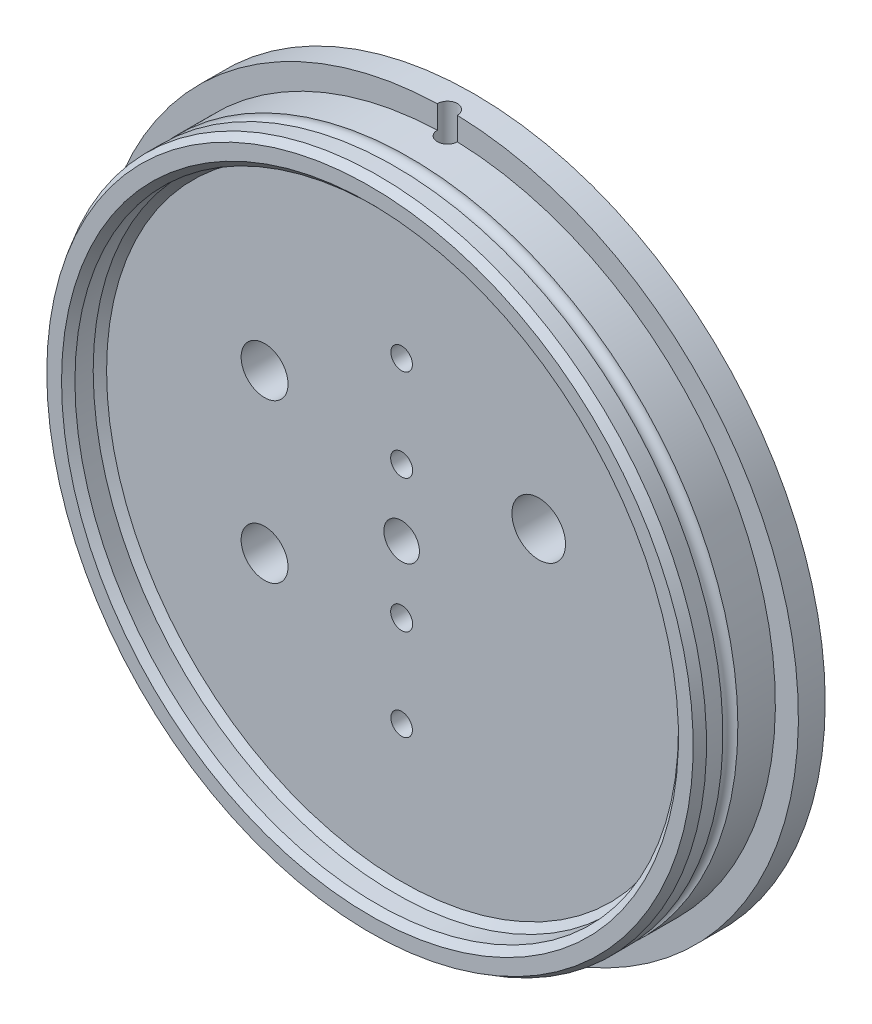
ISO-10303-21;
HEADER;
FILE_DESCRIPTION(('STEP AP214'),'2;1');
FILE_NAME('part.step','',(''),(''),'','','');
FILE_SCHEMA(('AUTOMOTIVE_DESIGN { 1 0 10303 214 1 1 1 1 }'));
ENDSEC;
DATA;
#1=APPLICATION_CONTEXT('core data for automotive mechanical design processes');
#2=APPLICATION_PROTOCOL_DEFINITION('international standard','automotive_design',2000,#1);
#3=PRODUCT_CONTEXT('',#1,'mechanical');
#4=PRODUCT('Part','Part','',(#3));
#5=PRODUCT_RELATED_PRODUCT_CATEGORY('part','',(#4));
#6=PRODUCT_DEFINITION_FORMATION('','',#4);
#7=PRODUCT_DEFINITION_CONTEXT('part definition',#1,'design');
#8=PRODUCT_DEFINITION('design','',#6,#7);
#9=PRODUCT_DEFINITION_SHAPE('','',#8);
#10=(LENGTH_UNIT() NAMED_UNIT(*) SI_UNIT(.MILLI.,.METRE.));
#11=(NAMED_UNIT(*) PLANE_ANGLE_UNIT() SI_UNIT($,.RADIAN.));
#12=(NAMED_UNIT(*) SI_UNIT($,.STERADIAN.) SOLID_ANGLE_UNIT());
#13=UNCERTAINTY_MEASURE_WITH_UNIT(LENGTH_MEASURE(1.E-05),#10,'distance_accuracy_value','');
#14=(GEOMETRIC_REPRESENTATION_CONTEXT(3) GLOBAL_UNCERTAINTY_ASSIGNED_CONTEXT((#13)) GLOBAL_UNIT_ASSIGNED_CONTEXT((#10,
#11,#12)) REPRESENTATION_CONTEXT('',''));
#15=CARTESIAN_POINT('',(0.,0.,0.));
#16=DIRECTION('',(0.,0.,1.));
#17=DIRECTION('',(1.,0.,0.));
#18=AXIS2_PLACEMENT_3D('',#15,#16,#17);
#19=CARTESIAN_POINT('',(0.,0.,24.9418));
#20=DIRECTION('',(0.,0.,1.));
#21=DIRECTION('',(1.,0.,0.));
#22=AXIS2_PLACEMENT_3D('',#19,#20,#21);
#23=CYLINDRICAL_SURFACE('',#22,1.905);
#24=CARTESIAN_POINT('',(0.,0.,32.257));
#25=DIRECTION('',(0.,0.,1.));
#26=DIRECTION('',(1.,0.,0.));
#27=AXIS2_PLACEMENT_3D('',#24,#25,#26);
#28=CIRCLE('',#27,1.905);
#29=CARTESIAN_POINT('',(1.905,0.,32.257));
#30=VERTEX_POINT('',#29);
#31=EDGE_CURVE('E98',#30,#30,#28,.T.);
#32=ORIENTED_EDGE('',*,*,#31,.T.);
#33=EDGE_LOOP('',(#32));
#34=FACE_BOUND('',#33,.T.);
#35=CARTESIAN_POINT('',(0.,0.,28.1168));
#36=DIRECTION('',(0.,0.,-1.));
#37=DIRECTION('',(-1.,0.,0.));
#38=AXIS2_PLACEMENT_3D('',#35,#36,#37);
#39=CIRCLE('',#38,1.905);
#40=CARTESIAN_POINT('',(-1.905,0.,28.1168));
#41=VERTEX_POINT('',#40);
#42=EDGE_CURVE('E312',#41,#41,#39,.T.);
#43=ORIENTED_EDGE('',*,*,#42,.T.);
#44=EDGE_LOOP('',(#43));
#45=FACE_BOUND('',#44,.T.);
#46=ADVANCED_FACE('F52',(#34,#45),#23,.F.);
#47=CARTESIAN_POINT('',(-83.1850015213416,0.,30.));
#48=DIRECTION('',(0.,0.,-1.));
#49=DIRECTION('',(-1.,0.,0.));
#50=AXIS2_PLACEMENT_3D('',#47,#48,#49);
#51=PLANE('',#50);
#52=CARTESIAN_POINT('',(0.,0.,30.));
#53=DIRECTION('',(0.,0.,-1.));
#54=DIRECTION('',(-1.,0.,0.));
#55=AXIS2_PLACEMENT_3D('',#52,#53,#54);
#56=CIRCLE('',#55,83.185);
#57=CARTESIAN_POINT('',(2.38125000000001,83.1509102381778,30.));
#58=VERTEX_POINT('',#57);
#59=CARTESIAN_POINT('',(-2.38124999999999,83.1509102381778,30.));
#60=VERTEX_POINT('',#59);
#61=EDGE_CURVE('E69',#58,#60,#56,.T.);
#62=ORIENTED_EDGE('',*,*,#61,.F.);
#63=DIRECTION('',(0.,1.,0.));
#64=VECTOR('',#63,1.);
#65=CARTESIAN_POINT('',(2.38125000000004,72.9026000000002,30.));
#66=LINE('',#65,#64);
#67=CARTESIAN_POINT('',(2.38125000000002,77.6921161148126,30.));
#68=VERTEX_POINT('',#67);
#69=EDGE_CURVE('E87',#58,#68,#66,.F.);
#70=ORIENTED_EDGE('',*,*,#69,.T.);
#71=CARTESIAN_POINT('',(1.87350135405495E-13,0.,30.));
#72=DIRECTION('',(0.,0.,1.));
#73=DIRECTION('',(1.,0.,0.));
#74=AXIS2_PLACEMENT_3D('',#71,#72,#73);
#75=CIRCLE('',#74,77.7286000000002);
#76=CARTESIAN_POINT('',(-2.38124999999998,77.6921161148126,30.));
#77=VERTEX_POINT('',#76);
#78=EDGE_CURVE('E231',#77,#68,#75,.T.);
#79=ORIENTED_EDGE('',*,*,#78,.F.);
#80=DIRECTION('',(0.,1.,0.));
#81=VECTOR('',#80,1.);
#82=CARTESIAN_POINT('',(-2.38124999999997,72.9026000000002,30.));
#83=LINE('',#82,#81);
#84=EDGE_CURVE('E76',#77,#60,#83,.T.);
#85=ORIENTED_EDGE('',*,*,#84,.T.);
#86=EDGE_LOOP('',(#62,#70,#79,#85));
#87=FACE_BOUND('',#86,.T.);
#88=ADVANCED_FACE('F85',(#87),#51,.F.);
#89=CARTESIAN_POINT('',(-83.1850015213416,85.4620754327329,23.65));
#90=DIRECTION('',(0.,0.,1.));
#91=DIRECTION('',(0.,-1.,0.));
#92=AXIS2_PLACEMENT_3D('',#89,#90,#91);
#93=PLANE('',#92);
#94=CARTESIAN_POINT('',(0.,0.,23.65));
#95=DIRECTION('',(0.,0.,1.));
#96=DIRECTION('',(0.,-1.,0.));
#97=AXIS2_PLACEMENT_3D('',#94,#95,#96);
#98=CIRCLE('',#97,70.1675000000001);
#99=CARTESIAN_POINT('',(0.,-70.1675000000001,23.65));
#100=VERTEX_POINT('',#99);
#101=EDGE_CURVE('E274',#100,#100,#98,.T.);
#102=ORIENTED_EDGE('',*,*,#101,.T.);
#103=EDGE_LOOP('',(#102));
#104=FACE_BOUND('',#103,.T.);
#105=CARTESIAN_POINT('',(0.,0.,23.65));
#106=DIRECTION('',(0.,0.,-1.));
#107=DIRECTION('',(0.,1.,0.));
#108=AXIS2_PLACEMENT_3D('',#105,#106,#107);
#109=CIRCLE('',#108,83.185);
#110=CARTESIAN_POINT('',(0.,83.185,23.65));
#111=VERTEX_POINT('',#110);
#112=EDGE_CURVE('E89',#111,#111,#109,.T.);
#113=ORIENTED_EDGE('',*,*,#112,.T.);
#114=EDGE_LOOP('',(#113));
#115=FACE_BOUND('',#114,.T.);
#116=ADVANCED_FACE('F119',(#104,#115),#93,.F.);
#117=CARTESIAN_POINT('',(0.,72.9026000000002,30.));
#118=DIRECTION('',(0.,1.,0.));
#119=DIRECTION('',(-1.,0.,0.));
#120=AXIS2_PLACEMENT_3D('',#117,#118,#119);
#121=CYLINDRICAL_SURFACE('',#120,2.38125);
#122=CARTESIAN_POINT('',(0.,72.9026000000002,30.));
#123=DIRECTION('',(0.,1.,0.));
#124=DIRECTION('',(-1.,0.,0.));
#125=AXIS2_PLACEMENT_3D('',#122,#123,#124);
#126=CIRCLE('',#125,2.38125);
#127=CARTESIAN_POINT('',(-2.38124999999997,72.9026000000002,30.));
#128=VERTEX_POINT('',#127);
#129=EDGE_CURVE('E94',#128,#128,#126,.T.);
#130=ORIENTED_EDGE('',*,*,#129,.F.);
#131=EDGE_LOOP('',(#130));
#132=FACE_BOUND('',#131,.T.);
#133=CARTESIAN_POINT('',(-2.38124999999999,83.1509102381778,30.));
#134=CARTESIAN_POINT('',(-2.38124407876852,83.1509106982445,29.8662735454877));
#135=CARTESIAN_POINT('',(-2.36994745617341,83.1512362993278,29.7324508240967));
#136=CARTESIAN_POINT('',(-2.3250408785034,83.152503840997,29.4684929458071));
#137=CARTESIAN_POINT('',(-2.29140425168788,83.153446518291,29.3383623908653));
#138=CARTESIAN_POINT('',(-2.20277781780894,83.1558413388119,29.0856510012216));
#139=CARTESIAN_POINT('',(-2.14779843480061,83.1572932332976,28.9630665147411));
#140=CARTESIAN_POINT('',(-2.01806204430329,83.1605425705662,28.7289012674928));
#141=CARTESIAN_POINT('',(-1.94330987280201,83.1623399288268,28.6173178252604));
#142=CARTESIAN_POINT('',(-1.77611207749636,83.1660785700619,28.4082399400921));
#143=CARTESIAN_POINT('',(-1.68366008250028,83.1680199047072,28.3107505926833));
#144=CARTESIAN_POINT('',(-1.48369791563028,83.171827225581,28.1326710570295));
#145=CARTESIAN_POINT('',(-1.37618714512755,83.1736932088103,28.0520815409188));
#146=CARTESIAN_POINT('',(-1.14914135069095,83.1771397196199,27.9100821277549));
#147=CARTESIAN_POINT('',(-1.02960448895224,83.1787202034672,27.8486751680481));
#148=CARTESIAN_POINT('',(-0.781912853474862,83.1814171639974,27.7468031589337));
#149=CARTESIAN_POINT('',(-0.653758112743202,83.1825336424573,27.7063380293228));
#150=CARTESIAN_POINT('',(-0.392505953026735,83.1841764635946,27.647508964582));
#151=CARTESIAN_POINT('',(-0.259409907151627,83.1847029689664,27.6291389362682));
#152=CARTESIAN_POINT('',(0.00797780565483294,83.1851070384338,27.6150027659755));
#153=CARTESIAN_POINT('',(0.142269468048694,83.184984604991,27.6192365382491));
#154=CARTESIAN_POINT('',(0.408195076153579,83.1841047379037,27.6501826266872));
#155=CARTESIAN_POINT('',(0.539829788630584,83.1833474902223,27.6768883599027));
#156=CARTESIAN_POINT('',(0.796746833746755,83.1812835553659,27.7520101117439));
#157=CARTESIAN_POINT('',(0.922029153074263,83.1799768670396,27.8004261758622));
#158=CARTESIAN_POINT('',(1.16270624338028,83.1769610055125,27.9176017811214));
#159=CARTESIAN_POINT('',(1.27809954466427,83.175251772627,27.9863643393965));
#160=CARTESIAN_POINT('',(1.49570686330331,83.171623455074,28.142278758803));
#161=CARTESIAN_POINT('',(1.59792085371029,83.1697043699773,28.2294306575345));
#162=CARTESIAN_POINT('',(1.78630645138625,83.1658718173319,28.4196871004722));
#163=CARTESIAN_POINT('',(1.87247228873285,83.1639583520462,28.5227973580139));
#164=CARTESIAN_POINT('',(2.02627121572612,83.1603534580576,28.7420234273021));
#165=CARTESIAN_POINT('',(2.09390430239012,83.1586620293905,28.8581392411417));
#166=CARTESIAN_POINT('',(2.20871722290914,83.1556919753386,29.1000835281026));
#167=CARTESIAN_POINT('',(2.25589687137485,83.1544133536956,29.2259120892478));
#168=CARTESIAN_POINT('',(2.32845994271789,83.1524132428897,29.4837085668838));
#169=CARTESIAN_POINT('',(2.3538434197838,83.1516917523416,29.6156764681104));
#170=CARTESIAN_POINT('',(2.38208652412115,83.150887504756,29.8819553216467));
#171=CARTESIAN_POINT('',(2.38495414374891,83.1508045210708,30.0162654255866));
#172=CARTESIAN_POINT('',(2.36810495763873,83.1512860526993,30.2834601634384));
#173=CARTESIAN_POINT('',(2.34838817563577,83.1518505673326,30.4163447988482));
#174=CARTESIAN_POINT('',(2.28693649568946,83.1535632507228,30.676894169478));
#175=CARTESIAN_POINT('',(2.24520522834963,83.154711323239,30.8045597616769));
#176=CARTESIAN_POINT('',(2.14091286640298,83.1574616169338,31.0510733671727));
#177=CARTESIAN_POINT('',(2.07835173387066,83.1590638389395,31.1699213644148));
#178=CARTESIAN_POINT('',(1.93415493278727,83.1625423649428,31.3954629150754));
#179=CARTESIAN_POINT('',(1.85251388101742,83.1644187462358,31.5021530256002));
#180=CARTESIAN_POINT('',(1.67248264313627,83.1682337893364,31.7003156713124));
#181=CARTESIAN_POINT('',(1.57409241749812,83.170172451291,31.7917881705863));
#182=CARTESIAN_POINT('',(1.36332155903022,83.1738941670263,31.9569456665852));
#183=CARTESIAN_POINT('',(1.25093688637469,83.1756771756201,32.030625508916));
#184=CARTESIAN_POINT('',(1.01538798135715,83.1788859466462,32.1580709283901));
#185=CARTESIAN_POINT('',(0.892223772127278,83.1803117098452,32.2118365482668));
#186=CARTESIAN_POINT('',(0.638631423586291,83.1826450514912,32.2979182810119));
#187=CARTESIAN_POINT('',(0.50820441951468,83.1835527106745,32.3302377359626));
#188=CARTESIAN_POINT('',(0.243772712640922,83.1847478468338,32.3725206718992));
#189=CARTESIAN_POINT('',(0.109768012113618,83.1850353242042,32.3824841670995));
#190=CARTESIAN_POINT('',(-0.15796357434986,83.1849576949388,32.3797719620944));
#191=CARTESIAN_POINT('',(-0.291690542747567,83.1845928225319,32.3671043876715));
#192=CARTESIAN_POINT('',(-0.555118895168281,83.1832520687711,32.3195063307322));
#193=CARTESIAN_POINT('',(-0.684820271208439,83.1822761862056,32.2845758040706));
#194=CARTESIAN_POINT('',(-0.936518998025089,83.1798233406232,32.1934444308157));
#195=CARTESIAN_POINT('',(-1.05851621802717,83.1783463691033,32.1372432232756));
#196=CARTESIAN_POINT('',(-1.29134087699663,83.1750577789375,32.0051688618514));
#197=CARTESIAN_POINT('',(-1.40216872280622,83.1732461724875,31.9292964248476));
#198=CARTESIAN_POINT('',(-1.60954544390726,83.1694918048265,31.7600102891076));
#199=CARTESIAN_POINT('',(-1.70609070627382,83.1675490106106,31.6665921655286));
#200=CARTESIAN_POINT('',(-1.88215391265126,83.1637511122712,31.4648462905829));
#201=CARTESIAN_POINT('',(-1.96166763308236,83.1618960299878,31.3565148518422));
#202=CARTESIAN_POINT('',(-2.10142300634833,83.1584821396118,31.1279771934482));
#203=CARTESIAN_POINT('',(-2.16165242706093,83.1569235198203,31.0077634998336));
#204=CARTESIAN_POINT('',(-2.26100358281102,83.1542817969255,30.7590189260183));
#205=CARTESIAN_POINT('',(-2.30015050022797,83.1531981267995,30.6304981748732));
#206=CARTESIAN_POINT('',(-2.34584582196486,83.1519183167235,30.4176374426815));
#207=CARTESIAN_POINT('',(-2.35910569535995,83.1515419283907,30.3346792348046));
#208=CARTESIAN_POINT('',(-2.37680964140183,83.1510377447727,30.1678266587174));
#209=CARTESIAN_POINT('',(-2.38125371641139,83.1509099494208,30.0839322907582));
#210=CARTESIAN_POINT('',(-2.38124999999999,83.1509102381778,30.));
#211=B_SPLINE_CURVE_WITH_KNOTS('',3,(#133,#134,#135,#136,#137,#138,#139,#140,#141,#142,#143,
#144,#145,#146,#147,#148,#149,#150,#151,#152,#153,#154,#155,#156,#157,#158,#159,#160,#161,#162,
#163,#164,#165,#166,#167,#168,#169,#170,#171,#172,#173,#174,#175,#176,#177,#178,#179,#180,#181,
#182,#183,#184,#185,#186,#187,#188,#189,#190,#191,#192,#193,#194,#195,#196,#197,#198,#199,#200,
#201,#202,#203,#204,#205,#206,#207,#208,#209,#210),.UNSPECIFIED.,.T.,.F.,(4,2,2,2,2,2,2,2,2,2,2,
2,2,2,2,2,2,2,2,2,2,2,2,2,2,2,2,2,2,2,2,2,2,2,2,2,2,2,4),(0.,0.400873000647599,
0.802225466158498,1.20338215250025,1.60444081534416,2.00564411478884,2.40686336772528,
2.80814402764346,3.20942315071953,3.61059158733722,4.01175850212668,4.4128079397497,
4.81385821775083,5.21496799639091,5.61607859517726,6.01733313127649,6.41858773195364,
6.81984596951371,7.2211032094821,7.62221801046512,8.02333238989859,8.42438063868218,
8.82542961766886,9.22659188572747,9.62775510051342,10.02903439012,10.4303128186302,
10.8315286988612,11.232744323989,11.6338159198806,12.0348883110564,12.4359675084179,
12.8370320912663,13.2381979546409,13.6394631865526,14.0409824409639,14.4420210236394,
14.6936256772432,14.9452302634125),.UNSPECIFIED.);
#212=EDGE_CURVE('E14',#60,#58,#211,.T.);
#213=ORIENTED_EDGE('',*,*,#212,.F.);
#214=ORIENTED_EDGE('',*,*,#84,.F.);
#215=CARTESIAN_POINT('',(-2.38124999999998,77.6921161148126,30.));
#216=CARTESIAN_POINT('',(-2.38124957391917,77.6921156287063,30.0669774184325));
#217=CARTESIAN_POINT('',(-2.37842241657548,77.6922028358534,30.1339227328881));
#218=CARTESIAN_POINT('',(-2.36714385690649,77.6925474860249,30.2673340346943));
#219=CARTESIAN_POINT('',(-2.35869273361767,77.6928049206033,30.3338000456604));
#220=CARTESIAN_POINT('',(-2.32498316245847,77.6938237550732,30.531653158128));
#221=CARTESIAN_POINT('',(-2.29136829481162,77.6948317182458,30.661714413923));
#222=CARTESIAN_POINT('',(-2.2027906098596,77.6973932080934,30.9143382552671));
#223=CARTESIAN_POINT('',(-2.14781806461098,77.6989469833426,31.0368973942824));
#224=CARTESIAN_POINT('',(-2.01809373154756,77.7024243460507,31.271042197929));
#225=CARTESIAN_POINT('',(-1.94334568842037,77.7043478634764,31.3826299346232));
#226=CARTESIAN_POINT('',(-1.77616091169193,77.7083488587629,31.5917064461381));
#227=CARTESIAN_POINT('',(-1.68371862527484,77.7104263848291,31.6891907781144));
#228=CARTESIAN_POINT('',(-1.48376581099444,77.7145010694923,31.8672749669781));
#229=CARTESIAN_POINT('',(-1.37625299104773,77.7164982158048,31.9478722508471));
#230=CARTESIAN_POINT('',(-1.14920095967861,77.7201870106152,32.0898856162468));
#231=CARTESIAN_POINT('',(-1.02965991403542,77.7218786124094,32.1512987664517));
#232=CARTESIAN_POINT('',(-0.781965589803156,77.7247651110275,32.2531784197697));
#233=CARTESIAN_POINT('',(-0.653812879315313,77.7259600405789,32.2936463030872));
#234=CARTESIAN_POINT('',(-0.392566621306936,77.7277183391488,32.3524807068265));
#235=CARTESIAN_POINT('',(-0.259474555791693,77.7282818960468,32.3708538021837));
#236=CARTESIAN_POINT('',(0.00790923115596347,77.7287145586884,32.3849974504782));
#237=CARTESIAN_POINT('',(0.142200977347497,77.7285836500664,32.3807675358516));
#238=CARTESIAN_POINT('',(0.408120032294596,77.7276422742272,32.3498299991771));
#239=CARTESIAN_POINT('',(0.539748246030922,77.7268320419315,32.3231301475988));
#240=CARTESIAN_POINT('',(0.796652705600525,77.7246236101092,32.248022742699));
#241=CARTESIAN_POINT('',(0.921928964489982,77.7232254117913,32.1996152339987));
#242=CARTESIAN_POINT('',(1.1626014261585,77.7199981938,32.0824566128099));
#243=CARTESIAN_POINT('',(1.27799568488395,77.7181690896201,32.0137015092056));
#244=CARTESIAN_POINT('',(1.49560093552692,77.7142863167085,31.85780569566));
#245=CARTESIAN_POINT('',(1.59781253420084,77.7122326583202,31.7706658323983));
#246=CARTESIAN_POINT('',(1.78618896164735,77.7081314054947,31.5804444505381));
#247=CARTESIAN_POINT('',(1.87234933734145,77.7060838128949,31.4773585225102));
#248=CARTESIAN_POINT('',(2.0261691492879,77.7022254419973,31.2581414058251));
#249=CARTESIAN_POINT('',(2.09382272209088,77.7004147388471,31.1420060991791));
#250=CARTESIAN_POINT('',(2.20870461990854,77.6972341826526,30.8999695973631));
#251=CARTESIAN_POINT('',(2.2559203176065,77.6958646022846,30.7740624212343));
#252=CARTESIAN_POINT('',(2.32846918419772,77.6937245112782,30.5162008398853));
#253=CARTESIAN_POINT('',(2.35383574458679,77.6929530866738,30.3842559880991));
#254=CARTESIAN_POINT('',(2.37238822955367,77.6923872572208,30.2095250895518));
#255=CARTESIAN_POINT('',(2.37571314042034,77.692285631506,30.1676522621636));
#256=CARTESIAN_POINT('',(2.38014099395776,77.6921501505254,30.0838586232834));
#257=CARTESIAN_POINT('',(2.38124760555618,77.6921161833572,30.0419380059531));
#258=CARTESIAN_POINT('',(2.38125000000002,77.6921161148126,30.));
#259=B_SPLINE_CURVE_WITH_KNOTS('',3,(#215,#216,#217,#218,#219,#220,#221,#222,#223,#224,#225,
#226,#227,#228,#229,#230,#231,#232,#233,#234,#235,#236,#237,#238,#239,#240,#241,#242,#243,#244,
#245,#246,#247,#248,#249,#250,#251,#252,#253,#254,#255,#256,#257,#258),.UNSPECIFIED.,.F.,.F.,(4,
2,2,2,2,2,2,2,2,2,2,2,2,2,2,2,2,2,2,2,2,4),(0.,0.20080878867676,0.401607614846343,
0.80255641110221,1.20368804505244,1.60474377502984,2.00592557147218,2.40716845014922,
2.80847260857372,3.20975031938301,3.61090858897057,4.01207515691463,4.41310305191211,
4.81413012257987,5.21523590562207,5.61632322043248,6.01752164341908,6.41884702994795,
6.82042001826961,7.22137819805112,7.34735135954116,7.47311599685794),.UNSPECIFIED.);
#260=EDGE_CURVE('E92',#77,#68,#259,.T.);
#261=ORIENTED_EDGE('',*,*,#260,.T.);
#262=ORIENTED_EDGE('',*,*,#69,.F.);
#263=EDGE_LOOP('',(#213,#214,#261,#262));
#264=FACE_BOUND('',#263,.T.);
#265=ADVANCED_FACE('F91',(#132,#264),#121,.F.);
#266=CARTESIAN_POINT('',(1.87350135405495E-13,0.,28.1168));
#267=DIRECTION('',(0.,0.,-1.));
#268=DIRECTION('',(-1.,0.,0.));
#269=AXIS2_PLACEMENT_3D('',#266,#267,#268);
#270=PLANE('',#269);
#271=CARTESIAN_POINT('',(0.,0.,28.1168));
#272=DIRECTION('',(0.,0.,-1.));
#273=DIRECTION('',(-1.,0.,0.));
#274=AXIS2_PLACEMENT_3D('',#271,#272,#273);
#275=CIRCLE('',#274,67.78625);
#276=CARTESIAN_POINT('',(-67.78625,0.,28.1168));
#277=VERTEX_POINT('',#276);
#278=EDGE_CURVE('E64',#277,#277,#275,.T.);
#279=ORIENTED_EDGE('',*,*,#278,.T.);
#280=EDGE_LOOP('',(#279));
#281=FACE_BOUND('',#280,.T.);
#282=CARTESIAN_POINT('',(32.4759526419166,18.7499999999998,28.1168));
#283=DIRECTION('',(0.,0.,-1.));
#284=DIRECTION('',(-1.,0.,0.));
#285=AXIS2_PLACEMENT_3D('',#282,#283,#284);
#286=CIRCLE('',#285,6.35);
#287=CARTESIAN_POINT('',(26.1259526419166,18.7499999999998,28.1168));
#288=VERTEX_POINT('',#287);
#289=EDGE_CURVE('E267',#288,#288,#286,.F.);
#290=ORIENTED_EDGE('',*,*,#289,.T.);
#291=EDGE_LOOP('',(#290));
#292=FACE_BOUND('',#291,.T.);
#293=CARTESIAN_POINT('',(-41.758190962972,-41.7581909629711,28.1168));
#294=DIRECTION('',(0.,0.,-1.));
#295=DIRECTION('',(-1.,0.,0.));
#296=AXIS2_PLACEMENT_3D('',#293,#294,#295);
#297=CIRCLE('',#296,1.64999999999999);
#298=CARTESIAN_POINT('',(-43.408190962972,-41.7581909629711,28.1168));
#299=VERTEX_POINT('',#298);
#300=EDGE_CURVE('E235',#299,#299,#297,.T.);
#301=ORIENTED_EDGE('',*,*,#300,.F.);
#302=EDGE_LOOP('',(#301));
#303=FACE_BOUND('',#302,.T.);
#304=CARTESIAN_POINT('',(-41.7581909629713,41.7581909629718,28.1168));
#305=DIRECTION('',(0.,0.,-1.));
#306=DIRECTION('',(-1.,0.,0.));
#307=AXIS2_PLACEMENT_3D('',#304,#305,#306);
#308=CIRCLE('',#307,1.65);
#309=CARTESIAN_POINT('',(-43.4081909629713,41.7581909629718,28.1168));
#310=VERTEX_POINT('',#309);
#311=EDGE_CURVE('E361',#310,#310,#308,.T.);
#312=ORIENTED_EDGE('',*,*,#311,.F.);
#313=EDGE_LOOP('',(#312));
#314=FACE_BOUND('',#313,.T.);
#315=CARTESIAN_POINT('',(41.758190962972,41.7581909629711,28.1168));
#316=DIRECTION('',(0.,0.,-1.));
#317=DIRECTION('',(-1.,0.,0.));
#318=AXIS2_PLACEMENT_3D('',#315,#316,#317);
#319=CIRCLE('',#318,1.65000000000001);
#320=CARTESIAN_POINT('',(40.108190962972,41.7581909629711,28.1168));
#321=VERTEX_POINT('',#320);
#322=EDGE_CURVE('E356',#321,#321,#319,.T.);
#323=ORIENTED_EDGE('',*,*,#322,.F.);
#324=EDGE_LOOP('',(#323));
#325=FACE_BOUND('',#324,.T.);
#326=CARTESIAN_POINT('',(41.7581909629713,-41.7581909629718,28.1168));
#327=DIRECTION('',(0.,0.,-1.));
#328=DIRECTION('',(-1.,0.,0.));
#329=AXIS2_PLACEMENT_3D('',#326,#327,#328);
#330=CIRCLE('',#329,1.65000000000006);
#331=CARTESIAN_POINT('',(40.1081909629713,-41.7581909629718,28.1168));
#332=VERTEX_POINT('',#331);
#333=EDGE_CURVE('E353',#332,#332,#330,.T.);
#334=ORIENTED_EDGE('',*,*,#333,.F.);
#335=EDGE_LOOP('',(#334));
#336=FACE_BOUND('',#335,.T.);
#337=CARTESIAN_POINT('',(-32.4759526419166,-18.7499999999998,28.1168));
#338=DIRECTION('',(0.,0.,-1.));
#339=DIRECTION('',(-1.,0.,0.));
#340=AXIS2_PLACEMENT_3D('',#337,#338,#339);
#341=CIRCLE('',#340,5.55625);
#342=CARTESIAN_POINT('',(-38.0322026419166,-18.7499999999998,28.1168));
#343=VERTEX_POINT('',#342);
#344=EDGE_CURVE('E359',#343,#343,#341,.F.);
#345=ORIENTED_EDGE('',*,*,#344,.T.);
#346=EDGE_LOOP('',(#345));
#347=FACE_BOUND('',#346,.T.);
#348=CARTESIAN_POINT('',(-32.4759526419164,18.75,28.1168));
#349=DIRECTION('',(0.,0.,-1.));
#350=DIRECTION('',(-1.,0.,0.));
#351=AXIS2_PLACEMENT_3D('',#348,#349,#350);
#352=CIRCLE('',#351,5.55625);
#353=CARTESIAN_POINT('',(-38.0322026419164,18.75,28.1168));
#354=VERTEX_POINT('',#353);
#355=EDGE_CURVE('E377',#354,#354,#352,.F.);
#356=ORIENTED_EDGE('',*,*,#355,.T.);
#357=EDGE_LOOP('',(#356));
#358=FACE_BOUND('',#357,.T.);
#359=ORIENTED_EDGE('',*,*,#42,.F.);
#360=EDGE_LOOP('',(#359));
#361=FACE_BOUND('',#360,.T.);
#362=ADVANCED_FACE('F118',(#281,#292,#303,#314,#325,#336,#347,#358,#361),#270,.T.);
#363=CARTESIAN_POINT('',(1.87350135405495E-13,0.,130.327878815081));
#364=DIRECTION('',(0.,0.,1.));
#365=DIRECTION('',(1.,0.,0.));
#366=AXIS2_PLACEMENT_3D('',#363,#364,#365);
#367=CYLINDRICAL_SURFACE('',#366,77.7286000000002);
#368=ORIENTED_EDGE('',*,*,#260,.F.);
#369=ORIENTED_EDGE('',*,*,#78,.T.);
#370=EDGE_LOOP('',(#368,#369));
#371=FACE_BOUND('',#370,.T.);
#372=CARTESIAN_POINT('',(0.,0.,38.89));
#373=DIRECTION('',(0.,0.,-1.));
#374=DIRECTION('',(-1.,0.,0.));
#375=AXIS2_PLACEMENT_3D('',#372,#373,#374);
#376=CIRCLE('',#375,77.7286000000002);
#377=CARTESIAN_POINT('',(-77.7286000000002,0.,38.89));
#378=VERTEX_POINT('',#377);
#379=EDGE_CURVE('E384',#378,#378,#376,.T.);
#380=ORIENTED_EDGE('',*,*,#379,.T.);
#381=EDGE_LOOP('',(#380));
#382=FACE_BOUND('',#381,.T.);
#383=ADVANCED_FACE('F212',(#371,#382),#367,.T.);
#384=CARTESIAN_POINT('',(0.,0.,42.446));
#385=DIRECTION('',(0.,0.,-1.));
#386=DIRECTION('',(-1.,0.,0.));
#387=AXIS2_PLACEMENT_3D('',#384,#385,#386);
#388=CIRCLE('',#387,77.7286000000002);
#389=CARTESIAN_POINT('',(-77.7286000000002,0.,42.446));
#390=VERTEX_POINT('',#389);
#391=EDGE_CURVE('E387',#390,#390,#388,.T.);
#392=ORIENTED_EDGE('',*,*,#391,.F.);
#393=EDGE_LOOP('',(#392));
#394=FACE_BOUND('',#393,.T.);
#395=CARTESIAN_POINT('',(1.87350135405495E-13,0.,46.3168000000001));
#396=DIRECTION('',(0.,0.,-1.));
#397=DIRECTION('',(-1.,0.,0.));
#398=AXIS2_PLACEMENT_3D('',#395,#396,#397);
#399=CIRCLE('',#398,77.7286000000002);
#400=CARTESIAN_POINT('',(-77.7286,0.,46.3168000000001));
#401=VERTEX_POINT('',#400);
#402=EDGE_CURVE('E229',#401,#401,#399,.F.);
#403=ORIENTED_EDGE('',*,*,#402,.F.);
#404=EDGE_LOOP('',(#403));
#405=FACE_BOUND('',#404,.T.);
#406=ADVANCED_FACE('F110',(#394,#405),#367,.T.);
#407=CARTESIAN_POINT('',(1.87350135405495E-13,0.,46.3168000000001));
#408=DIRECTION('',(0.,0.,-1.));
#409=DIRECTION('',(-1.,0.,0.));
#410=AXIS2_PLACEMENT_3D('',#407,#408,#409);
#411=CONICAL_SURFACE('',#410,77.7286000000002,0.523598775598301);
#412=CARTESIAN_POINT('',(1.87350135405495E-13,0.,48.3168));
#413=DIRECTION('',(0.,0.,-1.));
#414=DIRECTION('',(-1.,0.,0.));
#415=AXIS2_PLACEMENT_3D('',#412,#413,#414);
#416=CIRCLE('',#415,76.573899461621);
#417=CARTESIAN_POINT('',(-76.5738994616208,0.,48.3168));
#418=VERTEX_POINT('',#417);
#419=EDGE_CURVE('E226',#418,#418,#416,.T.);
#420=ORIENTED_EDGE('',*,*,#419,.T.);
#421=EDGE_LOOP('',(#420));
#422=FACE_BOUND('',#421,.T.);
#423=ORIENTED_EDGE('',*,*,#402,.T.);
#424=EDGE_LOOP('',(#423));
#425=FACE_BOUND('',#424,.T.);
#426=ADVANCED_FACE('F215',(#422,#425),#411,.T.);
#427=CARTESIAN_POINT('',(-77.7286,0.,48.3168));
#428=DIRECTION('',(0.,0.,-1.));
#429=DIRECTION('',(-1.,0.,0.));
#430=AXIS2_PLACEMENT_3D('',#427,#428,#429);
#431=PLANE('',#430);
#432=CARTESIAN_POINT('',(0.,0.,48.3168));
#433=DIRECTION('',(0.,0.,-1.));
#434=DIRECTION('',(-1.,0.,0.));
#435=AXIS2_PLACEMENT_3D('',#432,#433,#434);
#436=CIRCLE('',#435,73.0813994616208);
#437=CARTESIAN_POINT('',(-73.0813994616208,0.,48.3168));
#438=VERTEX_POINT('',#437);
#439=EDGE_CURVE('E271',#438,#438,#436,.T.);
#440=ORIENTED_EDGE('',*,*,#439,.T.);
#441=EDGE_LOOP('',(#440));
#442=FACE_BOUND('',#441,.T.);
#443=ORIENTED_EDGE('',*,*,#419,.F.);
#444=EDGE_LOOP('',(#443));
#445=FACE_BOUND('',#444,.T.);
#446=ADVANCED_FACE('F205',(#442,#445),#431,.F.);
#447=CARTESIAN_POINT('',(-41.758190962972,-41.7581909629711,35.7368));
#448=DIRECTION('',(0.,0.,-1.));
#449=DIRECTION('',(-1.,0.,0.));
#450=AXIS2_PLACEMENT_3D('',#447,#448,#449);
#451=CYLINDRICAL_SURFACE('',#450,1.64999999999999);
#452=CARTESIAN_POINT('',(-41.758190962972,-41.7581909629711,34.94305));
#453=DIRECTION('',(0.,0.,-1.));
#454=DIRECTION('',(-1.,0.,0.));
#455=AXIS2_PLACEMENT_3D('',#452,#453,#454);
#456=CIRCLE('',#455,1.64999999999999);
#457=CARTESIAN_POINT('',(-43.408190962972,-41.7581909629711,34.94305));
#458=VERTEX_POINT('',#457);
#459=EDGE_CURVE('E248',#458,#458,#456,.F.);
#460=CARTESIAN_POINT('',(-43.408190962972,-41.7581909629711,34.94305));
#461=CARTESIAN_POINT('',(-43.408190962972,-41.7581909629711,34.8719432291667));
#462=CARTESIAN_POINT('',(-43.408190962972,-41.7581909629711,34.8008364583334));
#463=CARTESIAN_POINT('',(-43.408190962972,-41.7581909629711,34.6586229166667));
#464=CARTESIAN_POINT('',(-43.408190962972,-41.7581909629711,34.5875161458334));
#465=CARTESIAN_POINT('',(-43.408190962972,-41.7581909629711,34.4453026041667));
#466=CARTESIAN_POINT('',(-43.408190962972,-41.7581909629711,34.3741958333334));
#467=CARTESIAN_POINT('',(-43.408190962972,-41.7581909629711,34.2319822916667));
#468=CARTESIAN_POINT('',(-43.408190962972,-41.7581909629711,34.1608755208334));
#469=CARTESIAN_POINT('',(-43.408190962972,-41.7581909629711,34.0186619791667));
#470=CARTESIAN_POINT('',(-43.408190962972,-41.7581909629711,33.9475552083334));
#471=CARTESIAN_POINT('',(-43.408190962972,-41.7581909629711,33.8053416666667));
#472=CARTESIAN_POINT('',(-43.408190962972,-41.7581909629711,33.7342348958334));
#473=CARTESIAN_POINT('',(-43.408190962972,-41.7581909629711,33.5920213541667));
#474=CARTESIAN_POINT('',(-43.408190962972,-41.7581909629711,33.5209145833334));
#475=CARTESIAN_POINT('',(-43.408190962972,-41.7581909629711,33.3787010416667));
#476=CARTESIAN_POINT('',(-43.408190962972,-41.7581909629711,33.3075942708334));
#477=CARTESIAN_POINT('',(-43.408190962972,-41.7581909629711,33.1653807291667));
#478=CARTESIAN_POINT('',(-43.408190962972,-41.7581909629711,33.0942739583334));
#479=CARTESIAN_POINT('',(-43.408190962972,-41.7581909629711,32.9520604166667));
#480=CARTESIAN_POINT('',(-43.408190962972,-41.7581909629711,32.8809536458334));
#481=CARTESIAN_POINT('',(-43.408190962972,-41.7581909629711,32.7387401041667));
#482=CARTESIAN_POINT('',(-43.408190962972,-41.7581909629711,32.6676333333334));
#483=CARTESIAN_POINT('',(-43.408190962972,-41.7581909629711,32.5254197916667));
#484=CARTESIAN_POINT('',(-43.408190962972,-41.7581909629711,32.4543130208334));
#485=CARTESIAN_POINT('',(-43.408190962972,-41.7581909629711,32.3120994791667));
#486=CARTESIAN_POINT('',(-43.408190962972,-41.7581909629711,32.2409927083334));
#487=CARTESIAN_POINT('',(-43.408190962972,-41.7581909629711,32.0987791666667));
#488=CARTESIAN_POINT('',(-43.408190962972,-41.7581909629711,32.0276723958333));
#489=CARTESIAN_POINT('',(-43.408190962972,-41.7581909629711,31.8854588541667));
#490=CARTESIAN_POINT('',(-43.408190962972,-41.7581909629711,31.8143520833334));
#491=CARTESIAN_POINT('',(-43.408190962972,-41.7581909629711,31.6721385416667));
#492=CARTESIAN_POINT('',(-43.408190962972,-41.7581909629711,31.6010317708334));
#493=CARTESIAN_POINT('',(-43.408190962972,-41.7581909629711,31.4588182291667));
#494=CARTESIAN_POINT('',(-43.408190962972,-41.7581909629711,31.3877114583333));
#495=CARTESIAN_POINT('',(-43.408190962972,-41.7581909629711,31.2454979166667));
#496=CARTESIAN_POINT('',(-43.408190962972,-41.7581909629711,31.1743911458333));
#497=CARTESIAN_POINT('',(-43.408190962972,-41.7581909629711,31.0321776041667));
#498=CARTESIAN_POINT('',(-43.408190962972,-41.7581909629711,30.9610708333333));
#499=CARTESIAN_POINT('',(-43.408190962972,-41.7581909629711,30.8188572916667));
#500=CARTESIAN_POINT('',(-43.408190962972,-41.7581909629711,30.7477505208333));
#501=CARTESIAN_POINT('',(-43.408190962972,-41.7581909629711,30.6055369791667));
#502=CARTESIAN_POINT('',(-43.408190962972,-41.7581909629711,30.5344302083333));
#503=CARTESIAN_POINT('',(-43.408190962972,-41.7581909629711,30.3922166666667));
#504=CARTESIAN_POINT('',(-43.408190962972,-41.7581909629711,30.3211098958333));
#505=CARTESIAN_POINT('',(-43.408190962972,-41.7581909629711,30.1788963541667));
#506=CARTESIAN_POINT('',(-43.408190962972,-41.7581909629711,30.1077895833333));
#507=CARTESIAN_POINT('',(-43.408190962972,-41.7581909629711,29.9655760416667));
#508=CARTESIAN_POINT('',(-43.408190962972,-41.7581909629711,29.8944692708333));
#509=CARTESIAN_POINT('',(-43.408190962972,-41.7581909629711,29.7522557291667));
#510=CARTESIAN_POINT('',(-43.408190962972,-41.7581909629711,29.6811489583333));
#511=CARTESIAN_POINT('',(-43.408190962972,-41.7581909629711,29.5389354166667));
#512=CARTESIAN_POINT('',(-43.408190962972,-41.7581909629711,29.4678286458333));
#513=CARTESIAN_POINT('',(-43.408190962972,-41.7581909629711,29.3256151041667));
#514=CARTESIAN_POINT('',(-43.408190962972,-41.7581909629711,29.2545083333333));
#515=CARTESIAN_POINT('',(-43.408190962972,-41.7581909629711,29.1122947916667));
#516=CARTESIAN_POINT('',(-43.408190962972,-41.7581909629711,29.0411880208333));
#517=CARTESIAN_POINT('',(-43.408190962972,-41.7581909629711,28.8989744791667));
#518=CARTESIAN_POINT('',(-43.408190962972,-41.7581909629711,28.8278677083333));
#519=CARTESIAN_POINT('',(-43.408190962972,-41.7581909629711,28.6856541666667));
#520=CARTESIAN_POINT('',(-43.408190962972,-41.7581909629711,28.6145473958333));
#521=CARTESIAN_POINT('',(-43.408190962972,-41.7581909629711,28.4723338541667));
#522=CARTESIAN_POINT('',(-43.408190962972,-41.7581909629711,28.4012270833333));
#523=CARTESIAN_POINT('',(-43.408190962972,-41.7581909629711,28.2590135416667));
#524=CARTESIAN_POINT('',(-43.408190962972,-41.7581909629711,28.1879067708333));
#525=CARTESIAN_POINT('',(-43.408190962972,-41.7581909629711,28.1168));
#526=B_SPLINE_CURVE_WITH_KNOTS('',3,(#460,#461,#462,#463,#464,#465,#466,#467,#468,#469,#470,
#471,#472,#473,#474,#475,#476,#477,#478,#479,#480,#481,#482,#483,#484,#485,#486,#487,#488,#489,
#490,#491,#492,#493,#494,#495,#496,#497,#498,#499,#500,#501,#502,#503,#504,#505,#506,#507,#508,
#509,#510,#511,#512,#513,#514,#515,#516,#517,#518,#519,#520,#521,#522,#523,#524,#525),
.UNSPECIFIED.,.F.,.F.,(4,2,2,2,2,2,2,2,2,2,2,2,2,2,2,2,2,2,2,2,2,2,2,2,2,2,2,2,2,2,2,2,4),(0.,
0.213320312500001,0.426640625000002,0.63996093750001,0.853281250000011,1.06660156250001,
1.27992187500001,1.49324218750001,1.70656250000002,1.91988281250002,2.13320312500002,
2.34652343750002,2.55984375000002,2.77316406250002,2.98648437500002,3.19980468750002,
3.41312500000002,3.62644531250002,3.83976562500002,4.05308593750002,4.26640625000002,
4.47972656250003,4.69304687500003,4.90636718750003,5.11968750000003,5.33300781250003,
5.54632812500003,5.75964843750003,5.97296875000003,6.18628906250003,6.39960937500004,
6.61292968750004,6.82625000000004),.UNSPECIFIED.);
#527=EDGE_CURVE('BSEAM201',#458,#299,#526,.T.);
#528=ORIENTED_EDGE('',*,*,#459,.T.);
#529=ORIENTED_EDGE('',*,*,#300,.T.);
#530=ORIENTED_EDGE('',*,*,#527,.T.);
#531=ORIENTED_EDGE('',*,*,#527,.F.);
#532=EDGE_LOOP('',(#528,#530,#529,#531));
#533=FACE_BOUND('',#532,.T.);
#534=ADVANCED_FACE('F201',(#533),#451,.F.);
#535=CARTESIAN_POINT('',(0.,0.,35.7368));
#536=DIRECTION('',(0.,0.,-1.));
#537=DIRECTION('',(-1.,0.,0.));
#538=AXIS2_PLACEMENT_3D('',#535,#536,#537);
#539=PLANE('',#538);
#540=CARTESIAN_POINT('',(-41.758190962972,-41.7581909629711,35.7368));
#541=DIRECTION('',(0.,0.,-1.));
#542=DIRECTION('',(-1.,0.,0.));
#543=AXIS2_PLACEMENT_3D('',#540,#541,#542);
#544=CIRCLE('',#543,0.856250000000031);
#545=CARTESIAN_POINT('',(-42.6144409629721,-41.7581909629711,35.7368));
#546=VERTEX_POINT('',#545);
#547=EDGE_CURVE('E245',#546,#546,#544,.T.);
#548=ORIENTED_EDGE('',*,*,#547,.T.);
#549=EDGE_LOOP('',(#548));
#550=FACE_BOUND('',#549,.T.);
#551=ADVANCED_FACE('F181',(#550),#539,.T.);
#552=CARTESIAN_POINT('',(-41.7581909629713,41.7581909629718,35.7368));
#553=DIRECTION('',(0.,0.,-1.));
#554=DIRECTION('',(-1.,0.,0.));
#555=AXIS2_PLACEMENT_3D('',#552,#553,#554);
#556=CYLINDRICAL_SURFACE('',#555,1.65);
#557=CARTESIAN_POINT('',(-41.7581909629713,41.7581909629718,34.9430500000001));
#558=DIRECTION('',(0.,0.,-1.));
#559=DIRECTION('',(-1.,0.,0.));
#560=AXIS2_PLACEMENT_3D('',#557,#558,#559);
#561=CIRCLE('',#560,1.65);
#562=CARTESIAN_POINT('',(-43.4081909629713,41.7581909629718,34.9430500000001));
#563=VERTEX_POINT('',#562);
#564=EDGE_CURVE('E260',#563,#563,#561,.F.);
#565=CARTESIAN_POINT('',(-43.4081909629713,41.7581909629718,34.9430500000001));
#566=CARTESIAN_POINT('',(-43.4081909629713,41.7581909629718,34.8719432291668));
#567=CARTESIAN_POINT('',(-43.4081909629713,41.7581909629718,34.8008364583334));
#568=CARTESIAN_POINT('',(-43.4081909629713,41.7581909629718,34.6586229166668));
#569=CARTESIAN_POINT('',(-43.4081909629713,41.7581909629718,34.5875161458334));
#570=CARTESIAN_POINT('',(-43.4081909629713,41.7581909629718,34.4453026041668));
#571=CARTESIAN_POINT('',(-43.4081909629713,41.7581909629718,34.3741958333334));
#572=CARTESIAN_POINT('',(-43.4081909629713,41.7581909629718,34.2319822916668));
#573=CARTESIAN_POINT('',(-43.4081909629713,41.7581909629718,34.1608755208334));
#574=CARTESIAN_POINT('',(-43.4081909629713,41.7581909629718,34.0186619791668));
#575=CARTESIAN_POINT('',(-43.4081909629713,41.7581909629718,33.9475552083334));
#576=CARTESIAN_POINT('',(-43.4081909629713,41.7581909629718,33.8053416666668));
#577=CARTESIAN_POINT('',(-43.4081909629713,41.7581909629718,33.7342348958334));
#578=CARTESIAN_POINT('',(-43.4081909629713,41.7581909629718,33.5920213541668));
#579=CARTESIAN_POINT('',(-43.4081909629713,41.7581909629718,33.5209145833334));
#580=CARTESIAN_POINT('',(-43.4081909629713,41.7581909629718,33.3787010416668));
#581=CARTESIAN_POINT('',(-43.4081909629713,41.7581909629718,33.3075942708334));
#582=CARTESIAN_POINT('',(-43.4081909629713,41.7581909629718,33.1653807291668));
#583=CARTESIAN_POINT('',(-43.4081909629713,41.7581909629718,33.0942739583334));
#584=CARTESIAN_POINT('',(-43.4081909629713,41.7581909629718,32.9520604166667));
#585=CARTESIAN_POINT('',(-43.4081909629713,41.7581909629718,32.8809536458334));
#586=CARTESIAN_POINT('',(-43.4081909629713,41.7581909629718,32.7387401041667));
#587=CARTESIAN_POINT('',(-43.4081909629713,41.7581909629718,32.6676333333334));
#588=CARTESIAN_POINT('',(-43.4081909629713,41.7581909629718,32.5254197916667));
#589=CARTESIAN_POINT('',(-43.4081909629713,41.7581909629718,32.4543130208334));
#590=CARTESIAN_POINT('',(-43.4081909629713,41.7581909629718,32.3120994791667));
#591=CARTESIAN_POINT('',(-43.4081909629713,41.7581909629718,32.2409927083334));
#592=CARTESIAN_POINT('',(-43.4081909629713,41.7581909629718,32.0987791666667));
#593=CARTESIAN_POINT('',(-43.4081909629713,41.7581909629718,32.0276723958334));
#594=CARTESIAN_POINT('',(-43.4081909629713,41.7581909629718,31.8854588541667));
#595=CARTESIAN_POINT('',(-43.4081909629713,41.7581909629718,31.8143520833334));
#596=CARTESIAN_POINT('',(-43.4081909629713,41.7581909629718,31.6721385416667));
#597=CARTESIAN_POINT('',(-43.4081909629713,41.7581909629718,31.6010317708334));
#598=CARTESIAN_POINT('',(-43.4081909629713,41.7581909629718,31.4588182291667));
#599=CARTESIAN_POINT('',(-43.4081909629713,41.7581909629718,31.3877114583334));
#600=CARTESIAN_POINT('',(-43.4081909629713,41.7581909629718,31.2454979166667));
#601=CARTESIAN_POINT('',(-43.4081909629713,41.7581909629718,31.1743911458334));
#602=CARTESIAN_POINT('',(-43.4081909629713,41.7581909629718,31.0321776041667));
#603=CARTESIAN_POINT('',(-43.4081909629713,41.7581909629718,30.9610708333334));
#604=CARTESIAN_POINT('',(-43.4081909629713,41.7581909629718,30.8188572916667));
#605=CARTESIAN_POINT('',(-43.4081909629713,41.7581909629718,30.7477505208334));
#606=CARTESIAN_POINT('',(-43.4081909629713,41.7581909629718,30.6055369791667));
#607=CARTESIAN_POINT('',(-43.4081909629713,41.7581909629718,30.5344302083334));
#608=CARTESIAN_POINT('',(-43.4081909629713,41.7581909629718,30.3922166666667));
#609=CARTESIAN_POINT('',(-43.4081909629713,41.7581909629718,30.3211098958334));
#610=CARTESIAN_POINT('',(-43.4081909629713,41.7581909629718,30.1788963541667));
#611=CARTESIAN_POINT('',(-43.4081909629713,41.7581909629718,30.1077895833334));
#612=CARTESIAN_POINT('',(-43.4081909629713,41.7581909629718,29.9655760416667));
#613=CARTESIAN_POINT('',(-43.4081909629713,41.7581909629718,29.8944692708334));
#614=CARTESIAN_POINT('',(-43.4081909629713,41.7581909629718,29.7522557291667));
#615=CARTESIAN_POINT('',(-43.4081909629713,41.7581909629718,29.6811489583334));
#616=CARTESIAN_POINT('',(-43.4081909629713,41.7581909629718,29.5389354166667));
#617=CARTESIAN_POINT('',(-43.4081909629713,41.7581909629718,29.4678286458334));
#618=CARTESIAN_POINT('',(-43.4081909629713,41.7581909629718,29.3256151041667));
#619=CARTESIAN_POINT('',(-43.4081909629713,41.7581909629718,29.2545083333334));
#620=CARTESIAN_POINT('',(-43.4081909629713,41.7581909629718,29.1122947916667));
#621=CARTESIAN_POINT('',(-43.4081909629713,41.7581909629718,29.0411880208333));
#622=CARTESIAN_POINT('',(-43.4081909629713,41.7581909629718,28.8989744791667));
#623=CARTESIAN_POINT('',(-43.4081909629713,41.7581909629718,28.8278677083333));
#624=CARTESIAN_POINT('',(-43.4081909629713,41.7581909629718,28.6856541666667));
#625=CARTESIAN_POINT('',(-43.4081909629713,41.7581909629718,28.6145473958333));
#626=CARTESIAN_POINT('',(-43.4081909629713,41.7581909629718,28.4723338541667));
#627=CARTESIAN_POINT('',(-43.4081909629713,41.7581909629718,28.4012270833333));
#628=CARTESIAN_POINT('',(-43.4081909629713,41.7581909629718,28.2590135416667));
#629=CARTESIAN_POINT('',(-43.4081909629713,41.7581909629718,28.1879067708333));
#630=CARTESIAN_POINT('',(-43.4081909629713,41.7581909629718,28.1168));
#631=B_SPLINE_CURVE_WITH_KNOTS('',3,(#565,#566,#567,#568,#569,#570,#571,#572,#573,#574,#575,
#576,#577,#578,#579,#580,#581,#582,#583,#584,#585,#586,#587,#588,#589,#590,#591,#592,#593,#594,
#595,#596,#597,#598,#599,#600,#601,#602,#603,#604,#605,#606,#607,#608,#609,#610,#611,#612,#613,
#614,#615,#616,#617,#618,#619,#620,#621,#622,#623,#624,#625,#626,#627,#628,#629,#630),
.UNSPECIFIED.,.F.,.F.,(4,2,2,2,2,2,2,2,2,2,2,2,2,2,2,2,2,2,2,2,2,2,2,2,2,2,2,2,2,2,2,2,4),(0.,
0.213320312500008,0.426640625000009,0.639960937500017,0.853281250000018,1.06660156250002,
1.27992187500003,1.49324218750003,1.70656250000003,1.91988281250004,2.13320312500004,
2.34652343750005,2.55984375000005,2.77316406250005,2.98648437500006,3.19980468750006,
3.41312500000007,3.62644531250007,3.83976562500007,4.05308593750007,4.26640625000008,
4.47972656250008,4.69304687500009,4.90636718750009,5.11968750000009,5.3330078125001,
5.5463281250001,5.7596484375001,5.97296875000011,6.18628906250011,6.39960937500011,
6.61292968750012,6.82625000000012),.UNSPECIFIED.);
#632=EDGE_CURVE('BSEAM177',#563,#310,#631,.T.);
#633=ORIENTED_EDGE('',*,*,#564,.T.);
#634=ORIENTED_EDGE('',*,*,#311,.T.);
#635=ORIENTED_EDGE('',*,*,#632,.T.);
#636=ORIENTED_EDGE('',*,*,#632,.F.);
#637=EDGE_LOOP('',(#633,#635,#634,#636));
#638=FACE_BOUND('',#637,.T.);
#639=ADVANCED_FACE('F177',(#638),#556,.F.);
#640=CARTESIAN_POINT('',(0.,0.,35.7368));
#641=DIRECTION('',(0.,0.,-1.));
#642=DIRECTION('',(-1.,0.,0.));
#643=AXIS2_PLACEMENT_3D('',#640,#641,#642);
#644=PLANE('',#643);
#645=CARTESIAN_POINT('',(-41.7581909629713,41.7581909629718,35.7368));
#646=DIRECTION('',(0.,0.,-1.));
#647=DIRECTION('',(-1.,0.,0.));
#648=AXIS2_PLACEMENT_3D('',#645,#646,#647);
#649=CIRCLE('',#648,0.856250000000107);
#650=CARTESIAN_POINT('',(-42.6144409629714,41.7581909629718,35.7368));
#651=VERTEX_POINT('',#650);
#652=EDGE_CURVE('E257',#651,#651,#649,.T.);
#653=ORIENTED_EDGE('',*,*,#652,.T.);
#654=EDGE_LOOP('',(#653));
#655=FACE_BOUND('',#654,.T.);
#656=ADVANCED_FACE('F173',(#655),#644,.T.);
#657=CARTESIAN_POINT('',(41.758190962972,41.7581909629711,35.7368));
#658=DIRECTION('',(0.,0.,-1.));
#659=DIRECTION('',(-1.,0.,0.));
#660=AXIS2_PLACEMENT_3D('',#657,#658,#659);
#661=CYLINDRICAL_SURFACE('',#660,1.65000000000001);
#662=CARTESIAN_POINT('',(41.758190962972,41.7581909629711,34.9430500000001));
#663=DIRECTION('',(0.,0.,-1.));
#664=DIRECTION('',(-1.,0.,0.));
#665=AXIS2_PLACEMENT_3D('',#662,#663,#664);
#666=CIRCLE('',#665,1.65000000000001);
#667=CARTESIAN_POINT('',(40.108190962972,41.7581909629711,34.9430500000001));
#668=VERTEX_POINT('',#667);
#669=EDGE_CURVE('E254',#668,#668,#666,.F.);
#670=CARTESIAN_POINT('',(40.108190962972,41.7581909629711,34.9430500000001));
#671=CARTESIAN_POINT('',(40.108190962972,41.7581909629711,34.8719432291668));
#672=CARTESIAN_POINT('',(40.108190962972,41.7581909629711,34.8008364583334));
#673=CARTESIAN_POINT('',(40.108190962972,41.7581909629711,34.6586229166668));
#674=CARTESIAN_POINT('',(40.108190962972,41.7581909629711,34.5875161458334));
#675=CARTESIAN_POINT('',(40.108190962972,41.7581909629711,34.4453026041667));
#676=CARTESIAN_POINT('',(40.108190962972,41.7581909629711,34.3741958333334));
#677=CARTESIAN_POINT('',(40.108190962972,41.7581909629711,34.2319822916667));
#678=CARTESIAN_POINT('',(40.108190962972,41.7581909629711,34.1608755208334));
#679=CARTESIAN_POINT('',(40.108190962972,41.7581909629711,34.0186619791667));
#680=CARTESIAN_POINT('',(40.108190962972,41.7581909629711,33.9475552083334));
#681=CARTESIAN_POINT('',(40.108190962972,41.7581909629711,33.8053416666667));
#682=CARTESIAN_POINT('',(40.108190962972,41.7581909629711,33.7342348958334));
#683=CARTESIAN_POINT('',(40.108190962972,41.7581909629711,33.5920213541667));
#684=CARTESIAN_POINT('',(40.108190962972,41.7581909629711,33.5209145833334));
#685=CARTESIAN_POINT('',(40.108190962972,41.7581909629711,33.3787010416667));
#686=CARTESIAN_POINT('',(40.108190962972,41.7581909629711,33.3075942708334));
#687=CARTESIAN_POINT('',(40.108190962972,41.7581909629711,33.1653807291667));
#688=CARTESIAN_POINT('',(40.108190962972,41.7581909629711,33.0942739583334));
#689=CARTESIAN_POINT('',(40.108190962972,41.7581909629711,32.9520604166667));
#690=CARTESIAN_POINT('',(40.108190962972,41.7581909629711,32.8809536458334));
#691=CARTESIAN_POINT('',(40.108190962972,41.7581909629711,32.7387401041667));
#692=CARTESIAN_POINT('',(40.108190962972,41.7581909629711,32.6676333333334));
#693=CARTESIAN_POINT('',(40.108190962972,41.7581909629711,32.5254197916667));
#694=CARTESIAN_POINT('',(40.108190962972,41.7581909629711,32.4543130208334));
#695=CARTESIAN_POINT('',(40.108190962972,41.7581909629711,32.3120994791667));
#696=CARTESIAN_POINT('',(40.108190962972,41.7581909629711,32.2409927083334));
#697=CARTESIAN_POINT('',(40.108190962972,41.7581909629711,32.0987791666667));
#698=CARTESIAN_POINT('',(40.108190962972,41.7581909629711,32.0276723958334));
#699=CARTESIAN_POINT('',(40.108190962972,41.7581909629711,31.8854588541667));
#700=CARTESIAN_POINT('',(40.108190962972,41.7581909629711,31.8143520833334));
#701=CARTESIAN_POINT('',(40.108190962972,41.7581909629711,31.6721385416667));
#702=CARTESIAN_POINT('',(40.108190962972,41.7581909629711,31.6010317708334));
#703=CARTESIAN_POINT('',(40.108190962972,41.7581909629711,31.4588182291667));
#704=CARTESIAN_POINT('',(40.108190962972,41.7581909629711,31.3877114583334));
#705=CARTESIAN_POINT('',(40.108190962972,41.7581909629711,31.2454979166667));
#706=CARTESIAN_POINT('',(40.108190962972,41.7581909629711,31.1743911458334));
#707=CARTESIAN_POINT('',(40.108190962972,41.7581909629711,31.0321776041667));
#708=CARTESIAN_POINT('',(40.108190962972,41.7581909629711,30.9610708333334));
#709=CARTESIAN_POINT('',(40.108190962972,41.7581909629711,30.8188572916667));
#710=CARTESIAN_POINT('',(40.108190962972,41.7581909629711,30.7477505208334));
#711=CARTESIAN_POINT('',(40.108190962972,41.7581909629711,30.6055369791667));
#712=CARTESIAN_POINT('',(40.108190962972,41.7581909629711,30.5344302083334));
#713=CARTESIAN_POINT('',(40.108190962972,41.7581909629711,30.3922166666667));
#714=CARTESIAN_POINT('',(40.108190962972,41.7581909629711,30.3211098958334));
#715=CARTESIAN_POINT('',(40.108190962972,41.7581909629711,30.1788963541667));
#716=CARTESIAN_POINT('',(40.108190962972,41.7581909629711,30.1077895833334));
#717=CARTESIAN_POINT('',(40.108190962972,41.7581909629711,29.9655760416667));
#718=CARTESIAN_POINT('',(40.108190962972,41.7581909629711,29.8944692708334));
#719=CARTESIAN_POINT('',(40.108190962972,41.7581909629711,29.7522557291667));
#720=CARTESIAN_POINT('',(40.108190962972,41.7581909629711,29.6811489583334));
#721=CARTESIAN_POINT('',(40.108190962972,41.7581909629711,29.5389354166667));
#722=CARTESIAN_POINT('',(40.108190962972,41.7581909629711,29.4678286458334));
#723=CARTESIAN_POINT('',(40.108190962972,41.7581909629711,29.3256151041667));
#724=CARTESIAN_POINT('',(40.108190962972,41.7581909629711,29.2545083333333));
#725=CARTESIAN_POINT('',(40.108190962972,41.7581909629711,29.1122947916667));
#726=CARTESIAN_POINT('',(40.108190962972,41.7581909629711,29.0411880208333));
#727=CARTESIAN_POINT('',(40.108190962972,41.7581909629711,28.8989744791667));
#728=CARTESIAN_POINT('',(40.108190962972,41.7581909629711,28.8278677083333));
#729=CARTESIAN_POINT('',(40.108190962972,41.7581909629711,28.6856541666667));
#730=CARTESIAN_POINT('',(40.108190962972,41.7581909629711,28.6145473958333));
#731=CARTESIAN_POINT('',(40.108190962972,41.7581909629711,28.4723338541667));
#732=CARTESIAN_POINT('',(40.108190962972,41.7581909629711,28.4012270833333));
#733=CARTESIAN_POINT('',(40.108190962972,41.7581909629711,28.2590135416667));
#734=CARTESIAN_POINT('',(40.108190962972,41.7581909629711,28.1879067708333));
#735=CARTESIAN_POINT('',(40.108190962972,41.7581909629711,28.1168));
#736=B_SPLINE_CURVE_WITH_KNOTS('',3,(#670,#671,#672,#673,#674,#675,#676,#677,#678,#679,#680,
#681,#682,#683,#684,#685,#686,#687,#688,#689,#690,#691,#692,#693,#694,#695,#696,#697,#698,#699,
#700,#701,#702,#703,#704,#705,#706,#707,#708,#709,#710,#711,#712,#713,#714,#715,#716,#717,#718,
#719,#720,#721,#722,#723,#724,#725,#726,#727,#728,#729,#730,#731,#732,#733,#734,#735),
.UNSPECIFIED.,.F.,.F.,(4,2,2,2,2,2,2,2,2,2,2,2,2,2,2,2,2,2,2,2,2,2,2,2,2,2,2,2,2,2,2,2,4),(0.,
0.213320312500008,0.426640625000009,0.63996093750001,0.853281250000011,1.06660156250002,
1.27992187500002,1.49324218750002,1.70656250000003,1.91988281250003,2.13320312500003,
2.34652343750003,2.55984375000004,2.77316406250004,2.98648437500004,3.19980468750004,
3.41312500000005,3.62644531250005,3.83976562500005,4.05308593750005,4.26640625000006,
4.47972656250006,4.69304687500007,4.90636718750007,5.11968750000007,5.33300781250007,
5.54632812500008,5.75964843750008,5.97296875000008,6.18628906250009,6.39960937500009,
6.61292968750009,6.82625000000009),.UNSPECIFIED.);
#737=EDGE_CURVE('BSEAM176',#668,#321,#736,.T.);
#738=ORIENTED_EDGE('',*,*,#669,.T.);
#739=ORIENTED_EDGE('',*,*,#322,.T.);
#740=ORIENTED_EDGE('',*,*,#737,.T.);
#741=ORIENTED_EDGE('',*,*,#737,.F.);
#742=EDGE_LOOP('',(#738,#740,#739,#741));
#743=FACE_BOUND('',#742,.T.);
#744=ADVANCED_FACE('F176',(#743),#661,.F.);
#745=CARTESIAN_POINT('',(0.,0.,35.7368));
#746=DIRECTION('',(0.,0.,-1.));
#747=DIRECTION('',(-1.,0.,0.));
#748=AXIS2_PLACEMENT_3D('',#745,#746,#747);
#749=PLANE('',#748);
#750=CARTESIAN_POINT('',(41.758190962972,41.7581909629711,35.7368));
#751=DIRECTION('',(0.,0.,-1.));
#752=DIRECTION('',(-1.,0.,0.));
#753=AXIS2_PLACEMENT_3D('',#750,#751,#752);
#754=CIRCLE('',#753,0.856250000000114);
#755=CARTESIAN_POINT('',(40.9019409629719,41.7581909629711,35.7368));
#756=VERTEX_POINT('',#755);
#757=EDGE_CURVE('E251',#756,#756,#754,.T.);
#758=ORIENTED_EDGE('',*,*,#757,.T.);
#759=EDGE_LOOP('',(#758));
#760=FACE_BOUND('',#759,.T.);
#761=ADVANCED_FACE('F183',(#760),#749,.T.);
#762=CARTESIAN_POINT('',(41.7581909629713,-41.7581909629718,35.7368));
#763=DIRECTION('',(0.,0.,-1.));
#764=DIRECTION('',(-1.,0.,0.));
#765=AXIS2_PLACEMENT_3D('',#762,#763,#764);
#766=CYLINDRICAL_SURFACE('',#765,1.65000000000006);
#767=CARTESIAN_POINT('',(41.7581909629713,-41.7581909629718,34.9430500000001));
#768=DIRECTION('',(0.,0.,-1.));
#769=DIRECTION('',(-1.,0.,0.));
#770=AXIS2_PLACEMENT_3D('',#767,#768,#769);
#771=CIRCLE('',#770,1.65000000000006);
#772=CARTESIAN_POINT('',(40.1081909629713,-41.7581909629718,34.9430500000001));
#773=VERTEX_POINT('',#772);
#774=EDGE_CURVE('E242',#773,#773,#771,.F.);
#775=CARTESIAN_POINT('',(40.1081909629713,-41.7581909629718,34.9430500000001));
#776=CARTESIAN_POINT('',(40.1081909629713,-41.7581909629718,34.8719432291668));
#777=CARTESIAN_POINT('',(40.1081909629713,-41.7581909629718,34.8008364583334));
#778=CARTESIAN_POINT('',(40.1081909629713,-41.7581909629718,34.6586229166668));
#779=CARTESIAN_POINT('',(40.1081909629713,-41.7581909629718,34.5875161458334));
#780=CARTESIAN_POINT('',(40.1081909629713,-41.7581909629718,34.4453026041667));
#781=CARTESIAN_POINT('',(40.1081909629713,-41.7581909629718,34.3741958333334));
#782=CARTESIAN_POINT('',(40.1081909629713,-41.7581909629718,34.2319822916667));
#783=CARTESIAN_POINT('',(40.1081909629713,-41.7581909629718,34.1608755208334));
#784=CARTESIAN_POINT('',(40.1081909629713,-41.7581909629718,34.0186619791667));
#785=CARTESIAN_POINT('',(40.1081909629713,-41.7581909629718,33.9475552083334));
#786=CARTESIAN_POINT('',(40.1081909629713,-41.7581909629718,33.8053416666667));
#787=CARTESIAN_POINT('',(40.1081909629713,-41.7581909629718,33.7342348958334));
#788=CARTESIAN_POINT('',(40.1081909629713,-41.7581909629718,33.5920213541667));
#789=CARTESIAN_POINT('',(40.1081909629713,-41.7581909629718,33.5209145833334));
#790=CARTESIAN_POINT('',(40.1081909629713,-41.7581909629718,33.3787010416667));
#791=CARTESIAN_POINT('',(40.1081909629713,-41.7581909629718,33.3075942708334));
#792=CARTESIAN_POINT('',(40.1081909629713,-41.7581909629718,33.1653807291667));
#793=CARTESIAN_POINT('',(40.1081909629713,-41.7581909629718,33.0942739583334));
#794=CARTESIAN_POINT('',(40.1081909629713,-41.7581909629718,32.9520604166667));
#795=CARTESIAN_POINT('',(40.1081909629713,-41.7581909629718,32.8809536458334));
#796=CARTESIAN_POINT('',(40.1081909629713,-41.7581909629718,32.7387401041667));
#797=CARTESIAN_POINT('',(40.1081909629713,-41.7581909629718,32.6676333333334));
#798=CARTESIAN_POINT('',(40.1081909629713,-41.7581909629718,32.5254197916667));
#799=CARTESIAN_POINT('',(40.1081909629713,-41.7581909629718,32.4543130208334));
#800=CARTESIAN_POINT('',(40.1081909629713,-41.7581909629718,32.3120994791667));
#801=CARTESIAN_POINT('',(40.1081909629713,-41.7581909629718,32.2409927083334));
#802=CARTESIAN_POINT('',(40.1081909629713,-41.7581909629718,32.0987791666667));
#803=CARTESIAN_POINT('',(40.1081909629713,-41.7581909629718,32.0276723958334));
#804=CARTESIAN_POINT('',(40.1081909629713,-41.7581909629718,31.8854588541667));
#805=CARTESIAN_POINT('',(40.1081909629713,-41.7581909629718,31.8143520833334));
#806=CARTESIAN_POINT('',(40.1081909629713,-41.7581909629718,31.6721385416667));
#807=CARTESIAN_POINT('',(40.1081909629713,-41.7581909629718,31.6010317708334));
#808=CARTESIAN_POINT('',(40.1081909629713,-41.7581909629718,31.4588182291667));
#809=CARTESIAN_POINT('',(40.1081909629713,-41.7581909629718,31.3877114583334));
#810=CARTESIAN_POINT('',(40.1081909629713,-41.7581909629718,31.2454979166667));
#811=CARTESIAN_POINT('',(40.1081909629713,-41.7581909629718,31.1743911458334));
#812=CARTESIAN_POINT('',(40.1081909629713,-41.7581909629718,31.0321776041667));
#813=CARTESIAN_POINT('',(40.1081909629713,-41.7581909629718,30.9610708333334));
#814=CARTESIAN_POINT('',(40.1081909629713,-41.7581909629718,30.8188572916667));
#815=CARTESIAN_POINT('',(40.1081909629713,-41.7581909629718,30.7477505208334));
#816=CARTESIAN_POINT('',(40.1081909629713,-41.7581909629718,30.6055369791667));
#817=CARTESIAN_POINT('',(40.1081909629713,-41.7581909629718,30.5344302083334));
#818=CARTESIAN_POINT('',(40.1081909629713,-41.7581909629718,30.3922166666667));
#819=CARTESIAN_POINT('',(40.1081909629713,-41.7581909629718,30.3211098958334));
#820=CARTESIAN_POINT('',(40.1081909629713,-41.7581909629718,30.1788963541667));
#821=CARTESIAN_POINT('',(40.1081909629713,-41.7581909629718,30.1077895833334));
#822=CARTESIAN_POINT('',(40.1081909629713,-41.7581909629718,29.9655760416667));
#823=CARTESIAN_POINT('',(40.1081909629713,-41.7581909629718,29.8944692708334));
#824=CARTESIAN_POINT('',(40.1081909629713,-41.7581909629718,29.7522557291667));
#825=CARTESIAN_POINT('',(40.1081909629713,-41.7581909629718,29.6811489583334));
#826=CARTESIAN_POINT('',(40.1081909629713,-41.7581909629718,29.5389354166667));
#827=CARTESIAN_POINT('',(40.1081909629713,-41.7581909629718,29.4678286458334));
#828=CARTESIAN_POINT('',(40.1081909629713,-41.7581909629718,29.3256151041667));
#829=CARTESIAN_POINT('',(40.1081909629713,-41.7581909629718,29.2545083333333));
#830=CARTESIAN_POINT('',(40.1081909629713,-41.7581909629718,29.1122947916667));
#831=CARTESIAN_POINT('',(40.1081909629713,-41.7581909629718,29.0411880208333));
#832=CARTESIAN_POINT('',(40.1081909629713,-41.7581909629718,28.8989744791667));
#833=CARTESIAN_POINT('',(40.1081909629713,-41.7581909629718,28.8278677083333));
#834=CARTESIAN_POINT('',(40.1081909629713,-41.7581909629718,28.6856541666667));
#835=CARTESIAN_POINT('',(40.1081909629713,-41.7581909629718,28.6145473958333));
#836=CARTESIAN_POINT('',(40.1081909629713,-41.7581909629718,28.4723338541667));
#837=CARTESIAN_POINT('',(40.1081909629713,-41.7581909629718,28.4012270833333));
#838=CARTESIAN_POINT('',(40.1081909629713,-41.7581909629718,28.2590135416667));
#839=CARTESIAN_POINT('',(40.1081909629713,-41.7581909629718,28.1879067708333));
#840=CARTESIAN_POINT('',(40.1081909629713,-41.7581909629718,28.1168));
#841=B_SPLINE_CURVE_WITH_KNOTS('',3,(#775,#776,#777,#778,#779,#780,#781,#782,#783,#784,#785,
#786,#787,#788,#789,#790,#791,#792,#793,#794,#795,#796,#797,#798,#799,#800,#801,#802,#803,#804,
#805,#806,#807,#808,#809,#810,#811,#812,#813,#814,#815,#816,#817,#818,#819,#820,#821,#822,#823,
#824,#825,#826,#827,#828,#829,#830,#831,#832,#833,#834,#835,#836,#837,#838,#839,#840),
.UNSPECIFIED.,.F.,.F.,(4,2,2,2,2,2,2,2,2,2,2,2,2,2,2,2,2,2,2,2,2,2,2,2,2,2,2,2,2,2,2,2,4),(0.,
0.213320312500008,0.426640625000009,0.63996093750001,0.853281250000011,1.06660156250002,
1.27992187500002,1.49324218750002,1.70656250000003,1.91988281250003,2.13320312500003,
2.34652343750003,2.55984375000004,2.77316406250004,2.98648437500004,3.19980468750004,
3.41312500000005,3.62644531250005,3.83976562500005,4.05308593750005,4.26640625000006,
4.47972656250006,4.69304687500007,4.90636718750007,5.11968750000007,5.33300781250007,
5.54632812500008,5.75964843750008,5.97296875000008,6.18628906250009,6.39960937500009,
6.61292968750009,6.82625000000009),.UNSPECIFIED.);
#842=EDGE_CURVE('BSEAM186',#773,#332,#841,.T.);
#843=ORIENTED_EDGE('',*,*,#774,.T.);
#844=ORIENTED_EDGE('',*,*,#333,.T.);
#845=ORIENTED_EDGE('',*,*,#842,.T.);
#846=ORIENTED_EDGE('',*,*,#842,.F.);
#847=EDGE_LOOP('',(#843,#845,#844,#846));
#848=FACE_BOUND('',#847,.T.);
#849=ADVANCED_FACE('F186',(#848),#766,.F.);
#850=CARTESIAN_POINT('',(0.,0.,35.7368));
#851=DIRECTION('',(0.,0.,-1.));
#852=DIRECTION('',(-1.,0.,0.));
#853=AXIS2_PLACEMENT_3D('',#850,#851,#852);
#854=PLANE('',#853);
#855=CARTESIAN_POINT('',(41.7581909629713,-41.7581909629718,35.7368));
#856=DIRECTION('',(0.,0.,-1.));
#857=DIRECTION('',(-1.,0.,0.));
#858=AXIS2_PLACEMENT_3D('',#855,#856,#857);
#859=CIRCLE('',#858,0.856250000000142);
#860=CARTESIAN_POINT('',(40.9019409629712,-41.7581909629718,35.7368));
#861=VERTEX_POINT('',#860);
#862=EDGE_CURVE('E233',#861,#861,#859,.T.);
#863=ORIENTED_EDGE('',*,*,#862,.T.);
#864=EDGE_LOOP('',(#863));
#865=FACE_BOUND('',#864,.T.);
#866=ADVANCED_FACE('F191',(#865),#854,.T.);
#867=CARTESIAN_POINT('',(41.7581909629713,-41.7581909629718,35.7368));
#868=DIRECTION('',(0.,0.,-1.));
#869=DIRECTION('',(-1.,0.,0.));
#870=AXIS2_PLACEMENT_3D('',#867,#868,#869);
#871=CONICAL_SURFACE('',#870,0.856250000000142,0.785398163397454);
#872=ORIENTED_EDGE('',*,*,#774,.F.);
#873=EDGE_LOOP('',(#872));
#874=FACE_BOUND('',#873,.T.);
#875=ORIENTED_EDGE('',*,*,#862,.F.);
#876=EDGE_LOOP('',(#875));
#877=FACE_BOUND('',#876,.T.);
#878=ADVANCED_FACE('F194',(#874,#877),#871,.F.);
#879=CARTESIAN_POINT('',(-41.758190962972,-41.7581909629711,35.7368));
#880=DIRECTION('',(0.,0.,-1.));
#881=DIRECTION('',(-1.,0.,0.));
#882=AXIS2_PLACEMENT_3D('',#879,#880,#881);
#883=CONICAL_SURFACE('',#882,0.856250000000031,0.785398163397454);
#884=ORIENTED_EDGE('',*,*,#459,.F.);
#885=EDGE_LOOP('',(#884));
#886=FACE_BOUND('',#885,.T.);
#887=ORIENTED_EDGE('',*,*,#547,.F.);
#888=EDGE_LOOP('',(#887));
#889=FACE_BOUND('',#888,.T.);
#890=ADVANCED_FACE('F483',(#886,#889),#883,.F.);
#891=CARTESIAN_POINT('',(41.758190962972,41.7581909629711,35.7368));
#892=DIRECTION('',(0.,0.,-1.));
#893=DIRECTION('',(-1.,0.,0.));
#894=AXIS2_PLACEMENT_3D('',#891,#892,#893);
#895=CONICAL_SURFACE('',#894,0.856250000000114,0.785398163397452);
#896=CARTESIAN_POINT('',(40.108190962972,41.7581909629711,34.9430500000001));
#897=CARTESIAN_POINT('',(40.1164591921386,41.7581909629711,34.9513182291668));
#898=CARTESIAN_POINT('',(40.1247274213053,41.7581909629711,34.9595864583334));
#899=CARTESIAN_POINT('',(40.1412638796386,41.7581909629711,34.9761229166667));
#900=CARTESIAN_POINT('',(40.1495321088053,41.7581909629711,34.9843911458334));
#901=CARTESIAN_POINT('',(40.1660685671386,41.7581909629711,35.0009276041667));
#902=CARTESIAN_POINT('',(40.1743367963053,41.7581909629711,35.0091958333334));
#903=CARTESIAN_POINT('',(40.1908732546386,41.7581909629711,35.0257322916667));
#904=CARTESIAN_POINT('',(40.1991414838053,41.7581909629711,35.0340005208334));
#905=CARTESIAN_POINT('',(40.2156779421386,41.7581909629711,35.0505369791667));
#906=CARTESIAN_POINT('',(40.2239461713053,41.7581909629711,35.0588052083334));
#907=CARTESIAN_POINT('',(40.2404826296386,41.7581909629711,35.0753416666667));
#908=CARTESIAN_POINT('',(40.2487508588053,41.7581909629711,35.0836098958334));
#909=CARTESIAN_POINT('',(40.2652873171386,41.7581909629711,35.1001463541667));
#910=CARTESIAN_POINT('',(40.2735555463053,41.7581909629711,35.1084145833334));
#911=CARTESIAN_POINT('',(40.2900920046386,41.7581909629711,35.1249510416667));
#912=CARTESIAN_POINT('',(40.2983602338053,41.7581909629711,35.1332192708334));
#913=CARTESIAN_POINT('',(40.3148966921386,41.7581909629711,35.1497557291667));
#914=CARTESIAN_POINT('',(40.3231649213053,41.7581909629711,35.1580239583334));
#915=CARTESIAN_POINT('',(40.3397013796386,41.7581909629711,35.1745604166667));
#916=CARTESIAN_POINT('',(40.3479696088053,41.7581909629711,35.1828286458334));
#917=CARTESIAN_POINT('',(40.3645060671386,41.7581909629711,35.1993651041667));
#918=CARTESIAN_POINT('',(40.3727742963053,41.7581909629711,35.2076333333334));
#919=CARTESIAN_POINT('',(40.3893107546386,41.7581909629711,35.2241697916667));
#920=CARTESIAN_POINT('',(40.3975789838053,41.7581909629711,35.2324380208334));
#921=CARTESIAN_POINT('',(40.4141154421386,41.7581909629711,35.2489744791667));
#922=CARTESIAN_POINT('',(40.4223836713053,41.7581909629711,35.2572427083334));
#923=CARTESIAN_POINT('',(40.4389201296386,41.7581909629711,35.2737791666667));
#924=CARTESIAN_POINT('',(40.4471883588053,41.7581909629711,35.2820473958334));
#925=CARTESIAN_POINT('',(40.4637248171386,41.7581909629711,35.2985838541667));
#926=CARTESIAN_POINT('',(40.4719930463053,41.7581909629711,35.3068520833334));
#927=CARTESIAN_POINT('',(40.4885295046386,41.7581909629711,35.3233885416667));
#928=CARTESIAN_POINT('',(40.4967977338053,41.7581909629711,35.3316567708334));
#929=CARTESIAN_POINT('',(40.5133341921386,41.7581909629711,35.3481932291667));
#930=CARTESIAN_POINT('',(40.5216024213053,41.7581909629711,35.3564614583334));
#931=CARTESIAN_POINT('',(40.5381388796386,41.7581909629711,35.3729979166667));
#932=CARTESIAN_POINT('',(40.5464071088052,41.7581909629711,35.3812661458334));
#933=CARTESIAN_POINT('',(40.5629435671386,41.7581909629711,35.3978026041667));
#934=CARTESIAN_POINT('',(40.5712117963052,41.7581909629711,35.4060708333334));
#935=CARTESIAN_POINT('',(40.5877482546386,41.7581909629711,35.4226072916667));
#936=CARTESIAN_POINT('',(40.5960164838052,41.7581909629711,35.4308755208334));
#937=CARTESIAN_POINT('',(40.6125529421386,41.7581909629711,35.4474119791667));
#938=CARTESIAN_POINT('',(40.6208211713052,41.7581909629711,35.4556802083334));
#939=CARTESIAN_POINT('',(40.6373576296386,41.7581909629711,35.4722166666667));
#940=CARTESIAN_POINT('',(40.6456258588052,41.7581909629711,35.4804848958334));
#941=CARTESIAN_POINT('',(40.6621623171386,41.7581909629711,35.4970213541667));
#942=CARTESIAN_POINT('',(40.6704305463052,41.7581909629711,35.5052895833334));
#943=CARTESIAN_POINT('',(40.6869670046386,41.7581909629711,35.5218260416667));
#944=CARTESIAN_POINT('',(40.6952352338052,41.7581909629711,35.5300942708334));
#945=CARTESIAN_POINT('',(40.7117716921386,41.7581909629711,35.5466307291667));
#946=CARTESIAN_POINT('',(40.7200399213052,41.7581909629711,35.5548989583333));
#947=CARTESIAN_POINT('',(40.7365763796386,41.7581909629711,35.5714354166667));
#948=CARTESIAN_POINT('',(40.7448446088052,41.7581909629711,35.5797036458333));
#949=CARTESIAN_POINT('',(40.7613810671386,41.7581909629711,35.5962401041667));
#950=CARTESIAN_POINT('',(40.7696492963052,41.7581909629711,35.6045083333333));
#951=CARTESIAN_POINT('',(40.7861857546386,41.7581909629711,35.6210447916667));
#952=CARTESIAN_POINT('',(40.7944539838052,41.7581909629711,35.6293130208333));
#953=CARTESIAN_POINT('',(40.8109904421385,41.7581909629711,35.6458494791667));
#954=CARTESIAN_POINT('',(40.8192586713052,41.7581909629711,35.6541177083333));
#955=CARTESIAN_POINT('',(40.8357951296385,41.7581909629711,35.6706541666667));
#956=CARTESIAN_POINT('',(40.8440633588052,41.7581909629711,35.6789223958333));
#957=CARTESIAN_POINT('',(40.8605998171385,41.7581909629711,35.6954588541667));
#958=CARTESIAN_POINT('',(40.8688680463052,41.7581909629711,35.7037270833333));
#959=CARTESIAN_POINT('',(40.8854045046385,41.7581909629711,35.7202635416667));
#960=CARTESIAN_POINT('',(40.8936727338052,41.7581909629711,35.7285317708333));
#961=CARTESIAN_POINT('',(40.9019409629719,41.7581909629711,35.7368));
#962=B_SPLINE_CURVE_WITH_KNOTS('',3,(#896,#897,#898,#899,#900,#901,#902,#903,#904,#905,#906,
#907,#908,#909,#910,#911,#912,#913,#914,#915,#916,#917,#918,#919,#920,#921,#922,#923,#924,#925,
#926,#927,#928,#929,#930,#931,#932,#933,#934,#935,#936,#937,#938,#939,#940,#941,#942,#943,#944,
#945,#946,#947,#948,#949,#950,#951,#952,#953,#954,#955,#956,#957,#958,#959,#960,#961),
.UNSPECIFIED.,.F.,.F.,(4,2,2,2,2,2,2,2,2,2,2,2,2,2,2,2,2,2,2,2,2,2,2,2,2,2,2,2,2,2,2,2,4),(0.,
0.0350791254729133,0.0701582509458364,0.10523737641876,0.140316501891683,0.175395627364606,
0.210474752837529,0.245553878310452,0.280633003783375,0.315712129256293,0.350791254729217,
0.38587038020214,0.420949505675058,0.456028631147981,0.491107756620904,0.526186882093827,
0.561266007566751,0.596345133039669,0.631424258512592,0.666503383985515,0.701582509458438,
0.736661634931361,0.771740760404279,0.806819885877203,0.841899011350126,0.876978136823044,
0.912057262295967,0.94713638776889,0.982215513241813,1.01729463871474,1.05237376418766,
1.08745288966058,1.1225320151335),.UNSPECIFIED.);
#963=EDGE_CURVE('BSEAM475',#668,#756,#962,.T.);
#964=ORIENTED_EDGE('',*,*,#669,.F.);
#965=ORIENTED_EDGE('',*,*,#757,.F.);
#966=ORIENTED_EDGE('',*,*,#963,.T.);
#967=ORIENTED_EDGE('',*,*,#963,.F.);
#968=EDGE_LOOP('',(#964,#966,#965,#967));
#969=FACE_BOUND('',#968,.T.);
#970=ADVANCED_FACE('F475',(#969),#895,.F.);
#971=CARTESIAN_POINT('',(-41.7581909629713,41.7581909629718,35.7368));
#972=DIRECTION('',(0.,0.,-1.));
#973=DIRECTION('',(-1.,0.,0.));
#974=AXIS2_PLACEMENT_3D('',#971,#972,#973);
#975=CONICAL_SURFACE('',#974,0.856250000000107,0.785398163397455);
#976=ORIENTED_EDGE('',*,*,#564,.F.);
#977=EDGE_LOOP('',(#976));
#978=FACE_BOUND('',#977,.T.);
#979=ORIENTED_EDGE('',*,*,#652,.F.);
#980=EDGE_LOOP('',(#979));
#981=FACE_BOUND('',#980,.T.);
#982=ADVANCED_FACE('F171',(#978,#981),#975,.F.);
#983=CARTESIAN_POINT('',(32.4759526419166,18.7499999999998,9.59591977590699));
#984=DIRECTION('',(0.,0.,1.));
#985=DIRECTION('',(1.,0.,0.));
#986=AXIS2_PLACEMENT_3D('',#983,#984,#985);
#987=CYLINDRICAL_SURFACE('',#986,6.35);
#988=CARTESIAN_POINT('',(32.4759526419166,18.7499999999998,40.8168));
#989=DIRECTION('',(0.,0.,-1.));
#990=DIRECTION('',(-1.,0.,0.));
#991=AXIS2_PLACEMENT_3D('',#988,#989,#990);
#992=CIRCLE('',#991,6.35);
#993=CARTESIAN_POINT('',(26.1259526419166,18.7499999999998,40.8168));
#994=VERTEX_POINT('',#993);
#995=EDGE_CURVE('E264',#994,#994,#992,.F.);
#996=ORIENTED_EDGE('',*,*,#995,.T.);
#997=EDGE_LOOP('',(#996));
#998=FACE_BOUND('',#997,.T.);
#999=ORIENTED_EDGE('',*,*,#289,.F.);
#1000=EDGE_LOOP('',(#999));
#1001=FACE_BOUND('',#1000,.T.);
#1002=ADVANCED_FACE('F167',(#998,#1001),#987,.F.);
#1003=CARTESIAN_POINT('',(1.87350135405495E-13,0.,40.8168));
#1004=DIRECTION('',(0.,0.,-1.));
#1005=DIRECTION('',(-1.,0.,0.));
#1006=AXIS2_PLACEMENT_3D('',#1003,#1004,#1005);
#1007=PLANE('',#1006);
#1008=CARTESIAN_POINT('',(0.,0.,40.8168));
#1009=DIRECTION('',(0.,0.,-1.));
#1010=DIRECTION('',(-1.,0.,0.));
#1011=AXIS2_PLACEMENT_3D('',#1008,#1009,#1010);
#1012=CIRCLE('',#1011,69.9063994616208);
#1013=CARTESIAN_POINT('',(-69.9063994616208,0.,40.8168));
#1014=VERTEX_POINT('',#1013);
#1015=EDGE_CURVE('E280',#1014,#1014,#1012,.F.);
#1016=ORIENTED_EDGE('',*,*,#1015,.T.);
#1017=EDGE_LOOP('',(#1016));
#1018=FACE_BOUND('',#1017,.T.);
#1019=CARTESIAN_POINT('',(0.,37.5,40.8168));
#1020=DIRECTION('',(0.,0.,1.));
#1021=DIRECTION('',(1.,0.,0.));
#1022=AXIS2_PLACEMENT_3D('',#1019,#1020,#1021);
#1023=CIRCLE('',#1022,2.5527);
#1024=CARTESIAN_POINT('',(2.5527,37.5,40.8168));
#1025=VERTEX_POINT('',#1024);
#1026=EDGE_CURVE('E321',#1025,#1025,#1023,.T.);
#1027=ORIENTED_EDGE('',*,*,#1026,.F.);
#1028=EDGE_LOOP('',(#1027));
#1029=FACE_BOUND('',#1028,.T.);
#1030=CARTESIAN_POINT('',(0.,-37.5,40.8168));
#1031=DIRECTION('',(0.,0.,1.));
#1032=DIRECTION('',(1.,0.,0.));
#1033=AXIS2_PLACEMENT_3D('',#1030,#1031,#1032);
#1034=CIRCLE('',#1033,2.5527);
#1035=CARTESIAN_POINT('',(2.5527,-37.5,40.8168));
#1036=VERTEX_POINT('',#1035);
#1037=EDGE_CURVE('E88',#1036,#1036,#1034,.T.);
#1038=ORIENTED_EDGE('',*,*,#1037,.F.);
#1039=EDGE_LOOP('',(#1038));
#1040=FACE_BOUND('',#1039,.T.);
#1041=CARTESIAN_POINT('',(0.,0.,40.8168));
#1042=DIRECTION('',(0.,0.,1.));
#1043=DIRECTION('',(1.,0.,0.));
#1044=AXIS2_PLACEMENT_3D('',#1041,#1042,#1043);
#1045=CIRCLE('',#1044,4.2164);
#1046=CARTESIAN_POINT('',(4.2164,0.,40.8168));
#1047=VERTEX_POINT('',#1046);
#1048=EDGE_CURVE('E320',#1047,#1047,#1045,.T.);
#1049=ORIENTED_EDGE('',*,*,#1048,.F.);
#1050=EDGE_LOOP('',(#1049));
#1051=FACE_BOUND('',#1050,.T.);
#1052=CARTESIAN_POINT('',(0.,15.7607,40.8168));
#1053=DIRECTION('',(0.,0.,1.));
#1054=DIRECTION('',(1.,0.,0.));
#1055=AXIS2_PLACEMENT_3D('',#1052,#1053,#1054);
#1056=CIRCLE('',#1055,2.6035);
#1057=CARTESIAN_POINT('',(2.6035,15.7607,40.8168));
#1058=VERTEX_POINT('',#1057);
#1059=EDGE_CURVE('E338',#1058,#1058,#1056,.T.);
#1060=ORIENTED_EDGE('',*,*,#1059,.F.);
#1061=EDGE_LOOP('',(#1060));
#1062=FACE_BOUND('',#1061,.T.);
#1063=CARTESIAN_POINT('',(0.,-15.7607,40.8168));
#1064=DIRECTION('',(0.,0.,1.));
#1065=DIRECTION('',(1.,0.,0.));
#1066=AXIS2_PLACEMENT_3D('',#1063,#1064,#1065);
#1067=CIRCLE('',#1066,2.6035);
#1068=CARTESIAN_POINT('',(2.6035,-15.7607,40.8168));
#1069=VERTEX_POINT('',#1068);
#1070=EDGE_CURVE('E107',#1069,#1069,#1067,.T.);
#1071=ORIENTED_EDGE('',*,*,#1070,.F.);
#1072=EDGE_LOOP('',(#1071));
#1073=FACE_BOUND('',#1072,.T.);
#1074=CARTESIAN_POINT('',(-32.4759526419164,18.75,40.8168));
#1075=DIRECTION('',(0.,0.,1.));
#1076=DIRECTION('',(1.,0.,0.));
#1077=AXIS2_PLACEMENT_3D('',#1074,#1075,#1076);
#1078=CIRCLE('',#1077,5.55625);
#1079=CARTESIAN_POINT('',(-26.9197026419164,18.75,40.8168));
#1080=VERTEX_POINT('',#1079);
#1081=EDGE_CURVE('E268',#1080,#1080,#1078,.T.);
#1082=ORIENTED_EDGE('',*,*,#1081,.F.);
#1083=EDGE_LOOP('',(#1082));
#1084=FACE_BOUND('',#1083,.T.);
#1085=CARTESIAN_POINT('',(-32.4759526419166,-18.7499999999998,40.8168));
#1086=DIRECTION('',(0.,0.,1.));
#1087=DIRECTION('',(1.,0.,0.));
#1088=AXIS2_PLACEMENT_3D('',#1085,#1086,#1087);
#1089=CIRCLE('',#1088,5.55625);
#1090=CARTESIAN_POINT('',(-26.9197026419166,-18.7499999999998,40.8168));
#1091=VERTEX_POINT('',#1090);
#1092=EDGE_CURVE('E348',#1091,#1091,#1089,.T.);
#1093=ORIENTED_EDGE('',*,*,#1092,.F.);
#1094=EDGE_LOOP('',(#1093));
#1095=FACE_BOUND('',#1094,.T.);
#1096=ORIENTED_EDGE('',*,*,#995,.F.);
#1097=EDGE_LOOP('',(#1096));
#1098=FACE_BOUND('',#1097,.T.);
#1099=ADVANCED_FACE('F163',(#1018,#1029,#1040,#1051,#1062,#1073,#1084,#1095,#1098),#1007,.F.);
#1100=CARTESIAN_POINT('',(-32.4759526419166,-18.7499999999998,12.401351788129));
#1101=DIRECTION('',(0.,0.,1.));
#1102=DIRECTION('',(1.,0.,0.));
#1103=AXIS2_PLACEMENT_3D('',#1100,#1101,#1102);
#1104=CYLINDRICAL_SURFACE('',#1103,5.55625);
#1105=ORIENTED_EDGE('',*,*,#1092,.T.);
#1106=EDGE_LOOP('',(#1105));
#1107=FACE_BOUND('',#1106,.T.);
#1108=ORIENTED_EDGE('',*,*,#344,.F.);
#1109=EDGE_LOOP('',(#1108));
#1110=FACE_BOUND('',#1109,.T.);
#1111=ADVANCED_FACE('F159',(#1107,#1110),#1104,.F.);
#1112=CARTESIAN_POINT('',(-32.4759526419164,18.75,12.401351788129));
#1113=DIRECTION('',(0.,0.,1.));
#1114=DIRECTION('',(1.,0.,0.));
#1115=AXIS2_PLACEMENT_3D('',#1112,#1113,#1114);
#1116=CYLINDRICAL_SURFACE('',#1115,5.55625);
#1117=ORIENTED_EDGE('',*,*,#1081,.T.);
#1118=EDGE_LOOP('',(#1117));
#1119=FACE_BOUND('',#1118,.T.);
#1120=ORIENTED_EDGE('',*,*,#355,.F.);
#1121=EDGE_LOOP('',(#1120));
#1122=FACE_BOUND('',#1121,.T.);
#1123=ADVANCED_FACE('F155',(#1119,#1122),#1116,.F.);
#1124=CARTESIAN_POINT('',(0.,0.,40.668));
#1125=DIRECTION('',(0.,0.,-1.));
#1126=DIRECTION('',(-1.,0.,0.));
#1127=AXIS2_PLACEMENT_3D('',#1124,#1125,#1126);
#1128=TOROIDAL_SURFACE('',#1127,77.7286000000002,1.77800000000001);
#1129=ORIENTED_EDGE('',*,*,#379,.F.);
#1130=EDGE_LOOP('',(#1129));
#1131=FACE_BOUND('',#1130,.T.);
#1132=ORIENTED_EDGE('',*,*,#391,.T.);
#1133=EDGE_LOOP('',(#1132));
#1134=FACE_BOUND('',#1133,.T.);
#1135=ADVANCED_FACE('F151',(#1131,#1134),#1128,.F.);
#1136=CARTESIAN_POINT('',(0.,0.,-178.405762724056));
#1137=DIRECTION('',(0.,0.,1.));
#1138=DIRECTION('',(1.,0.,0.));
#1139=AXIS2_PLACEMENT_3D('',#1136,#1137,#1138);
#1140=CYLINDRICAL_SURFACE('',#1139,68.58);
#1141=CARTESIAN_POINT('',(0.,0.,27.32305));
#1142=DIRECTION('',(0.,0.,-1.));
#1143=DIRECTION('',(-1.,0.,0.));
#1144=AXIS2_PLACEMENT_3D('',#1141,#1142,#1143);
#1145=CIRCLE('',#1144,68.58);
#1146=CARTESIAN_POINT('',(-68.58,0.,27.32305));
#1147=VERTEX_POINT('',#1146);
#1148=EDGE_CURVE('E289',#1147,#1147,#1145,.F.);
#1149=ORIENTED_EDGE('',*,*,#1148,.T.);
#1150=EDGE_LOOP('',(#1149));
#1151=FACE_BOUND('',#1150,.T.);
#1152=CARTESIAN_POINT('',(0.,0.,25.2375000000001));
#1153=DIRECTION('',(0.,0.,1.));
#1154=DIRECTION('',(1.,0.,0.));
#1155=AXIS2_PLACEMENT_3D('',#1152,#1153,#1154);
#1156=CIRCLE('',#1155,68.58);
#1157=CARTESIAN_POINT('',(68.58,0.,25.2375000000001));
#1158=VERTEX_POINT('',#1157);
#1159=EDGE_CURVE('E277',#1158,#1158,#1156,.F.);
#1160=ORIENTED_EDGE('',*,*,#1159,.T.);
#1161=EDGE_LOOP('',(#1160));
#1162=FACE_BOUND('',#1161,.T.);
#1163=ADVANCED_FACE('F147',(#1151,#1162),#1140,.F.);
#1164=CARTESIAN_POINT('',(0.,0.,-161.398484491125));
#1165=DIRECTION('',(0.,0.,1.));
#1166=DIRECTION('',(1.,0.,0.));
#1167=AXIS2_PLACEMENT_3D('',#1164,#1165,#1166);
#1168=CYLINDRICAL_SURFACE('',#1167,71.4938994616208);
#1169=CARTESIAN_POINT('',(0.,0.,42.4043));
#1170=DIRECTION('',(0.,0.,-1.));
#1171=DIRECTION('',(-1.,0.,0.));
#1172=AXIS2_PLACEMENT_3D('',#1169,#1170,#1171);
#1173=CIRCLE('',#1172,71.4938994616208);
#1174=CARTESIAN_POINT('',(-71.4938994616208,0.,42.4043));
#1175=VERTEX_POINT('',#1174);
#1176=EDGE_CURVE('E286',#1175,#1175,#1173,.T.);
#1177=ORIENTED_EDGE('',*,*,#1176,.T.);
#1178=EDGE_LOOP('',(#1177));
#1179=FACE_BOUND('',#1178,.T.);
#1180=CARTESIAN_POINT('',(0.,0.,46.7293));
#1181=DIRECTION('',(0.,0.,-1.));
#1182=DIRECTION('',(-1.,0.,0.));
#1183=AXIS2_PLACEMENT_3D('',#1180,#1181,#1182);
#1184=CIRCLE('',#1183,71.4938994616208);
#1185=CARTESIAN_POINT('',(-71.4938994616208,0.,46.7293));
#1186=VERTEX_POINT('',#1185);
#1187=EDGE_CURVE('E263',#1186,#1186,#1184,.F.);
#1188=ORIENTED_EDGE('',*,*,#1187,.T.);
#1189=EDGE_LOOP('',(#1188));
#1190=FACE_BOUND('',#1189,.T.);
#1191=ADVANCED_FACE('F144',(#1179,#1190),#1168,.F.);
#1192=CARTESIAN_POINT('',(0.,0.,46.7293));
#1193=DIRECTION('',(0.,0.,1.));
#1194=DIRECTION('',(1.,0.,0.));
#1195=AXIS2_PLACEMENT_3D('',#1192,#1193,#1194);
#1196=CONICAL_SURFACE('',#1195,71.4938994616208,0.785398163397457);
#1197=ORIENTED_EDGE('',*,*,#439,.F.);
#1198=EDGE_LOOP('',(#1197));
#1199=FACE_BOUND('',#1198,.T.);
#1200=ORIENTED_EDGE('',*,*,#1187,.F.);
#1201=EDGE_LOOP('',(#1200));
#1202=FACE_BOUND('',#1201,.T.);
#1203=ADVANCED_FACE('F139',(#1199,#1202),#1196,.F.);
#1204=CARTESIAN_POINT('',(0.,-15.7607,31.2918));
#1205=DIRECTION('',(0.,0.,1.));
#1206=DIRECTION('',(1.,0.,0.));
#1207=AXIS2_PLACEMENT_3D('',#1204,#1205,#1206);
#1208=CYLINDRICAL_SURFACE('',#1207,2.6035);
#1209=CARTESIAN_POINT('',(0.,-15.7607,31.2918));
#1210=DIRECTION('',(0.,0.,1.));
#1211=DIRECTION('',(1.,0.,0.));
#1212=AXIS2_PLACEMENT_3D('',#1209,#1210,#1211);
#1213=CIRCLE('',#1212,2.6035);
#1214=CARTESIAN_POINT('',(2.6035,-15.7607,31.2918));
#1215=VERTEX_POINT('',#1214);
#1216=EDGE_CURVE('E391',#1215,#1215,#1213,.T.);
#1217=CARTESIAN_POINT('',(2.6035,-15.7607,31.2918));
#1218=CARTESIAN_POINT('',(2.6035,-15.7607,31.39101875));
#1219=CARTESIAN_POINT('',(2.6035,-15.7607,31.4902375));
#1220=CARTESIAN_POINT('',(2.6035,-15.7607,31.688675));
#1221=CARTESIAN_POINT('',(2.6035,-15.7607,31.78789375));
#1222=CARTESIAN_POINT('',(2.6035,-15.7607,31.98633125));
#1223=CARTESIAN_POINT('',(2.6035,-15.7607,32.08555));
#1224=CARTESIAN_POINT('',(2.6035,-15.7607,32.2839875));
#1225=CARTESIAN_POINT('',(2.6035,-15.7607,32.38320625));
#1226=CARTESIAN_POINT('',(2.6035,-15.7607,32.58164375));
#1227=CARTESIAN_POINT('',(2.6035,-15.7607,32.6808625));
#1228=CARTESIAN_POINT('',(2.6035,-15.7607,32.8793));
#1229=CARTESIAN_POINT('',(2.6035,-15.7607,32.97851875));
#1230=CARTESIAN_POINT('',(2.6035,-15.7607,33.17695625));
#1231=CARTESIAN_POINT('',(2.6035,-15.7607,33.276175));
#1232=CARTESIAN_POINT('',(2.6035,-15.7607,33.4746125));
#1233=CARTESIAN_POINT('',(2.6035,-15.7607,33.57383125));
#1234=CARTESIAN_POINT('',(2.6035,-15.7607,33.77226875));
#1235=CARTESIAN_POINT('',(2.6035,-15.7607,33.8714875));
#1236=CARTESIAN_POINT('',(2.6035,-15.7607,34.069925));
#1237=CARTESIAN_POINT('',(2.6035,-15.7607,34.16914375));
#1238=CARTESIAN_POINT('',(2.6035,-15.7607,34.36758125));
#1239=CARTESIAN_POINT('',(2.6035,-15.7607,34.4668));
#1240=CARTESIAN_POINT('',(2.6035,-15.7607,34.6652375));
#1241=CARTESIAN_POINT('',(2.6035,-15.7607,34.76445625));
#1242=CARTESIAN_POINT('',(2.6035,-15.7607,34.96289375));
#1243=CARTESIAN_POINT('',(2.6035,-15.7607,35.0621125));
#1244=CARTESIAN_POINT('',(2.6035,-15.7607,35.26055));
#1245=CARTESIAN_POINT('',(2.6035,-15.7607,35.35976875));
#1246=CARTESIAN_POINT('',(2.6035,-15.7607,35.55820625));
#1247=CARTESIAN_POINT('',(2.6035,-15.7607,35.657425));
#1248=CARTESIAN_POINT('',(2.6035,-15.7607,35.8558625));
#1249=CARTESIAN_POINT('',(2.6035,-15.7607,35.95508125));
#1250=CARTESIAN_POINT('',(2.6035,-15.7607,36.15351875));
#1251=CARTESIAN_POINT('',(2.6035,-15.7607,36.2527375));
#1252=CARTESIAN_POINT('',(2.6035,-15.7607,36.451175));
#1253=CARTESIAN_POINT('',(2.6035,-15.7607,36.55039375));
#1254=CARTESIAN_POINT('',(2.6035,-15.7607,36.74883125));
#1255=CARTESIAN_POINT('',(2.6035,-15.7607,36.84805));
#1256=CARTESIAN_POINT('',(2.6035,-15.7607,37.0464875));
#1257=CARTESIAN_POINT('',(2.6035,-15.7607,37.14570625));
#1258=CARTESIAN_POINT('',(2.6035,-15.7607,37.34414375));
#1259=CARTESIAN_POINT('',(2.6035,-15.7607,37.4433625));
#1260=CARTESIAN_POINT('',(2.6035,-15.7607,37.6418));
#1261=CARTESIAN_POINT('',(2.6035,-15.7607,37.74101875));
#1262=CARTESIAN_POINT('',(2.6035,-15.7607,37.93945625));
#1263=CARTESIAN_POINT('',(2.6035,-15.7607,38.038675));
#1264=CARTESIAN_POINT('',(2.6035,-15.7607,38.2371125));
#1265=CARTESIAN_POINT('',(2.6035,-15.7607,38.33633125));
#1266=CARTESIAN_POINT('',(2.6035,-15.7607,38.53476875));
#1267=CARTESIAN_POINT('',(2.6035,-15.7607,38.6339875));
#1268=CARTESIAN_POINT('',(2.6035,-15.7607,38.832425));
#1269=CARTESIAN_POINT('',(2.6035,-15.7607,38.93164375));
#1270=CARTESIAN_POINT('',(2.6035,-15.7607,39.13008125));
#1271=CARTESIAN_POINT('',(2.6035,-15.7607,39.2293));
#1272=CARTESIAN_POINT('',(2.6035,-15.7607,39.4277375));
#1273=CARTESIAN_POINT('',(2.6035,-15.7607,39.52695625));
#1274=CARTESIAN_POINT('',(2.6035,-15.7607,39.72539375));
#1275=CARTESIAN_POINT('',(2.6035,-15.7607,39.8246125));
#1276=CARTESIAN_POINT('',(2.6035,-15.7607,40.02305));
#1277=CARTESIAN_POINT('',(2.6035,-15.7607,40.12226875));
#1278=CARTESIAN_POINT('',(2.6035,-15.7607,40.32070625));
#1279=CARTESIAN_POINT('',(2.6035,-15.7607,40.419925));
#1280=CARTESIAN_POINT('',(2.6035,-15.7607,40.6183625));
#1281=CARTESIAN_POINT('',(2.6035,-15.7607,40.71758125));
#1282=CARTESIAN_POINT('',(2.6035,-15.7607,40.8168));
#1283=B_SPLINE_CURVE_WITH_KNOTS('',3,(#1217,#1218,#1219,#1220,#1221,#1222,#1223,#1224,#1225,
#1226,#1227,#1228,#1229,#1230,#1231,#1232,#1233,#1234,#1235,#1236,#1237,#1238,#1239,#1240,#1241,
#1242,#1243,#1244,#1245,#1246,#1247,#1248,#1249,#1250,#1251,#1252,#1253,#1254,#1255,#1256,#1257,
#1258,#1259,#1260,#1261,#1262,#1263,#1264,#1265,#1266,#1267,#1268,#1269,#1270,#1271,#1272,#1273,
#1274,#1275,#1276,#1277,#1278,#1279,#1280,#1281,#1282),.UNSPECIFIED.,.F.,.F.,(4,2,2,2,2,2,2,2,2,
2,2,2,2,2,2,2,2,2,2,2,2,2,2,2,2,2,2,2,2,2,2,2,4),(0.,0.29765625,0.5953125,0.892968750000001,
1.190625,1.48828125,1.7859375,2.08359375,2.38125,2.67890625,2.9765625,3.27421875,3.571875,
3.86953125,4.1671875,4.46484375,4.7625,5.06015625,5.3578125,5.65546875,5.953125,6.25078125,
6.5484375,6.84609375,7.14375,7.44140625,7.7390625,8.03671875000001,8.334375,8.63203125,
8.92968750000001,9.22734375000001,9.52500000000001),.UNSPECIFIED.);
#1284=EDGE_CURVE('BSEAM135',#1215,#1069,#1283,.T.);
#1285=ORIENTED_EDGE('',*,*,#1216,.F.);
#1286=ORIENTED_EDGE('',*,*,#1070,.T.);
#1287=ORIENTED_EDGE('',*,*,#1284,.T.);
#1288=ORIENTED_EDGE('',*,*,#1284,.F.);
#1289=EDGE_LOOP('',(#1285,#1287,#1286,#1288));
#1290=FACE_BOUND('',#1289,.T.);
#1291=ADVANCED_FACE('F135',(#1290),#1208,.F.);
#1292=CARTESIAN_POINT('',(0.,0.,31.2918));
#1293=DIRECTION('',(0.,0.,1.));
#1294=DIRECTION('',(1.,0.,0.));
#1295=AXIS2_PLACEMENT_3D('',#1292,#1293,#1294);
#1296=PLANE('',#1295);
#1297=ORIENTED_EDGE('',*,*,#1216,.T.);
#1298=EDGE_LOOP('',(#1297));
#1299=FACE_BOUND('',#1298,.T.);
#1300=ADVANCED_FACE('F131',(#1299),#1296,.T.);
#1301=CARTESIAN_POINT('',(0.,15.7607,31.2918));
#1302=DIRECTION('',(0.,0.,1.));
#1303=DIRECTION('',(1.,0.,0.));
#1304=AXIS2_PLACEMENT_3D('',#1301,#1302,#1303);
#1305=CYLINDRICAL_SURFACE('',#1304,2.6035);
#1306=CARTESIAN_POINT('',(0.,15.7607,31.2918));
#1307=DIRECTION('',(0.,0.,1.));
#1308=DIRECTION('',(1.,0.,0.));
#1309=AXIS2_PLACEMENT_3D('',#1306,#1307,#1308);
#1310=CIRCLE('',#1309,2.6035);
#1311=CARTESIAN_POINT('',(2.6035,15.7607,31.2918));
#1312=VERTEX_POINT('',#1311);
#1313=EDGE_CURVE('E108',#1312,#1312,#1310,.T.);
#1314=CARTESIAN_POINT('',(2.6035,15.7607,31.2918));
#1315=CARTESIAN_POINT('',(2.6035,15.7607,31.39101875));
#1316=CARTESIAN_POINT('',(2.6035,15.7607,31.4902375));
#1317=CARTESIAN_POINT('',(2.6035,15.7607,31.688675));
#1318=CARTESIAN_POINT('',(2.6035,15.7607,31.78789375));
#1319=CARTESIAN_POINT('',(2.6035,15.7607,31.98633125));
#1320=CARTESIAN_POINT('',(2.6035,15.7607,32.08555));
#1321=CARTESIAN_POINT('',(2.6035,15.7607,32.2839875));
#1322=CARTESIAN_POINT('',(2.6035,15.7607,32.38320625));
#1323=CARTESIAN_POINT('',(2.6035,15.7607,32.58164375));
#1324=CARTESIAN_POINT('',(2.6035,15.7607,32.6808625));
#1325=CARTESIAN_POINT('',(2.6035,15.7607,32.8793));
#1326=CARTESIAN_POINT('',(2.6035,15.7607,32.97851875));
#1327=CARTESIAN_POINT('',(2.6035,15.7607,33.17695625));
#1328=CARTESIAN_POINT('',(2.6035,15.7607,33.276175));
#1329=CARTESIAN_POINT('',(2.6035,15.7607,33.4746125));
#1330=CARTESIAN_POINT('',(2.6035,15.7607,33.57383125));
#1331=CARTESIAN_POINT('',(2.6035,15.7607,33.77226875));
#1332=CARTESIAN_POINT('',(2.6035,15.7607,33.8714875));
#1333=CARTESIAN_POINT('',(2.6035,15.7607,34.069925));
#1334=CARTESIAN_POINT('',(2.6035,15.7607,34.16914375));
#1335=CARTESIAN_POINT('',(2.6035,15.7607,34.36758125));
#1336=CARTESIAN_POINT('',(2.6035,15.7607,34.4668));
#1337=CARTESIAN_POINT('',(2.6035,15.7607,34.6652375));
#1338=CARTESIAN_POINT('',(2.6035,15.7607,34.76445625));
#1339=CARTESIAN_POINT('',(2.6035,15.7607,34.96289375));
#1340=CARTESIAN_POINT('',(2.6035,15.7607,35.0621125));
#1341=CARTESIAN_POINT('',(2.6035,15.7607,35.26055));
#1342=CARTESIAN_POINT('',(2.6035,15.7607,35.35976875));
#1343=CARTESIAN_POINT('',(2.6035,15.7607,35.55820625));
#1344=CARTESIAN_POINT('',(2.6035,15.7607,35.657425));
#1345=CARTESIAN_POINT('',(2.6035,15.7607,35.8558625));
#1346=CARTESIAN_POINT('',(2.6035,15.7607,35.95508125));
#1347=CARTESIAN_POINT('',(2.6035,15.7607,36.15351875));
#1348=CARTESIAN_POINT('',(2.6035,15.7607,36.2527375));
#1349=CARTESIAN_POINT('',(2.6035,15.7607,36.451175));
#1350=CARTESIAN_POINT('',(2.6035,15.7607,36.55039375));
#1351=CARTESIAN_POINT('',(2.6035,15.7607,36.74883125));
#1352=CARTESIAN_POINT('',(2.6035,15.7607,36.84805));
#1353=CARTESIAN_POINT('',(2.6035,15.7607,37.0464875));
#1354=CARTESIAN_POINT('',(2.6035,15.7607,37.14570625));
#1355=CARTESIAN_POINT('',(2.6035,15.7607,37.34414375));
#1356=CARTESIAN_POINT('',(2.6035,15.7607,37.4433625));
#1357=CARTESIAN_POINT('',(2.6035,15.7607,37.6418));
#1358=CARTESIAN_POINT('',(2.6035,15.7607,37.74101875));
#1359=CARTESIAN_POINT('',(2.6035,15.7607,37.93945625));
#1360=CARTESIAN_POINT('',(2.6035,15.7607,38.038675));
#1361=CARTESIAN_POINT('',(2.6035,15.7607,38.2371125));
#1362=CARTESIAN_POINT('',(2.6035,15.7607,38.33633125));
#1363=CARTESIAN_POINT('',(2.6035,15.7607,38.53476875));
#1364=CARTESIAN_POINT('',(2.6035,15.7607,38.6339875));
#1365=CARTESIAN_POINT('',(2.6035,15.7607,38.832425));
#1366=CARTESIAN_POINT('',(2.6035,15.7607,38.93164375));
#1367=CARTESIAN_POINT('',(2.6035,15.7607,39.13008125));
#1368=CARTESIAN_POINT('',(2.6035,15.7607,39.2293));
#1369=CARTESIAN_POINT('',(2.6035,15.7607,39.4277375));
#1370=CARTESIAN_POINT('',(2.6035,15.7607,39.52695625));
#1371=CARTESIAN_POINT('',(2.6035,15.7607,39.72539375));
#1372=CARTESIAN_POINT('',(2.6035,15.7607,39.8246125));
#1373=CARTESIAN_POINT('',(2.6035,15.7607,40.02305));
#1374=CARTESIAN_POINT('',(2.6035,15.7607,40.12226875));
#1375=CARTESIAN_POINT('',(2.6035,15.7607,40.32070625));
#1376=CARTESIAN_POINT('',(2.6035,15.7607,40.419925));
#1377=CARTESIAN_POINT('',(2.6035,15.7607,40.6183625));
#1378=CARTESIAN_POINT('',(2.6035,15.7607,40.71758125));
#1379=CARTESIAN_POINT('',(2.6035,15.7607,40.8168));
#1380=B_SPLINE_CURVE_WITH_KNOTS('',3,(#1314,#1315,#1316,#1317,#1318,#1319,#1320,#1321,#1322,
#1323,#1324,#1325,#1326,#1327,#1328,#1329,#1330,#1331,#1332,#1333,#1334,#1335,#1336,#1337,#1338,
#1339,#1340,#1341,#1342,#1343,#1344,#1345,#1346,#1347,#1348,#1349,#1350,#1351,#1352,#1353,#1354,
#1355,#1356,#1357,#1358,#1359,#1360,#1361,#1362,#1363,#1364,#1365,#1366,#1367,#1368,#1369,#1370,
#1371,#1372,#1373,#1374,#1375,#1376,#1377,#1378,#1379),.UNSPECIFIED.,.F.,.F.,(4,2,2,2,2,2,2,2,2,
2,2,2,2,2,2,2,2,2,2,2,2,2,2,2,2,2,2,2,2,2,2,2,4),(0.,0.29765625,0.5953125,0.892968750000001,
1.190625,1.48828125,1.7859375,2.08359375,2.38125,2.67890625,2.9765625,3.27421875,3.571875,
3.86953125,4.1671875,4.46484375,4.7625,5.06015625,5.3578125,5.65546875,5.953125,6.25078125,
6.5484375,6.84609375,7.14375,7.44140625,7.7390625,8.03671875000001,8.334375,8.63203125,
8.92968750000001,9.22734375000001,9.52500000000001),.UNSPECIFIED.);
#1381=EDGE_CURVE('BSEAM127',#1312,#1058,#1380,.T.);
#1382=ORIENTED_EDGE('',*,*,#1313,.F.);
#1383=ORIENTED_EDGE('',*,*,#1059,.T.);
#1384=ORIENTED_EDGE('',*,*,#1381,.T.);
#1385=ORIENTED_EDGE('',*,*,#1381,.F.);
#1386=EDGE_LOOP('',(#1382,#1384,#1383,#1385));
#1387=FACE_BOUND('',#1386,.T.);
#1388=ADVANCED_FACE('F127',(#1387),#1305,.F.);
#1389=CARTESIAN_POINT('',(0.,0.,31.2918));
#1390=DIRECTION('',(0.,0.,1.));
#1391=DIRECTION('',(1.,0.,0.));
#1392=AXIS2_PLACEMENT_3D('',#1389,#1390,#1391);
#1393=PLANE('',#1392);
#1394=ORIENTED_EDGE('',*,*,#1313,.T.);
#1395=EDGE_LOOP('',(#1394));
#1396=FACE_BOUND('',#1395,.T.);
#1397=ADVANCED_FACE('F123',(#1396),#1393,.T.);
#1398=CARTESIAN_POINT('',(0.,72.9026000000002,30.));
#1399=DIRECTION('',(0.,1.,0.));
#1400=DIRECTION('',(-1.,0.,0.));
#1401=AXIS2_PLACEMENT_3D('',#1398,#1399,#1400);
#1402=PLANE('',#1401);
#1403=ORIENTED_EDGE('',*,*,#129,.T.);
#1404=EDGE_LOOP('',(#1403));
#1405=FACE_BOUND('',#1404,.T.);
#1406=ADVANCED_FACE('F121',(#1405),#1402,.T.);
#1407=CARTESIAN_POINT('',(0.,0.,23.65));
#1408=DIRECTION('',(0.,0.,-1.));
#1409=DIRECTION('',(-1.,0.,0.));
#1410=AXIS2_PLACEMENT_3D('',#1407,#1408,#1409);
#1411=CONICAL_SURFACE('',#1410,70.1675000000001,0.785398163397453);
#1412=ORIENTED_EDGE('',*,*,#1159,.F.);
#1413=EDGE_LOOP('',(#1412));
#1414=FACE_BOUND('',#1413,.T.);
#1415=ORIENTED_EDGE('',*,*,#101,.F.);
#1416=EDGE_LOOP('',(#1415));
#1417=FACE_BOUND('',#1416,.T.);
#1418=ADVANCED_FACE('F302',(#1414,#1417),#1411,.F.);
#1419=CARTESIAN_POINT('',(0.,0.,32.257));
#1420=DIRECTION('',(0.,0.,1.));
#1421=DIRECTION('',(1.,0.,0.));
#1422=AXIS2_PLACEMENT_3D('',#1419,#1420,#1421);
#1423=CYLINDRICAL_SURFACE('',#1422,4.2164);
#1424=CARTESIAN_POINT('',(0.,0.,32.257));
#1425=DIRECTION('',(0.,0.,1.));
#1426=DIRECTION('',(1.,0.,0.));
#1427=AXIS2_PLACEMENT_3D('',#1424,#1425,#1426);
#1428=CIRCLE('',#1427,4.2164);
#1429=CARTESIAN_POINT('',(4.2164,0.,32.257));
#1430=VERTEX_POINT('',#1429);
#1431=EDGE_CURVE('E283',#1430,#1430,#1428,.T.);
#1432=ORIENTED_EDGE('',*,*,#1431,.F.);
#1433=EDGE_LOOP('',(#1432));
#1434=FACE_BOUND('',#1433,.T.);
#1435=ORIENTED_EDGE('',*,*,#1048,.T.);
#1436=EDGE_LOOP('',(#1435));
#1437=FACE_BOUND('',#1436,.T.);
#1438=ADVANCED_FACE('F305',(#1434,#1437),#1423,.F.);
#1439=CARTESIAN_POINT('',(0.,0.,32.257));
#1440=DIRECTION('',(0.,0.,1.));
#1441=DIRECTION('',(1.,0.,0.));
#1442=AXIS2_PLACEMENT_3D('',#1439,#1440,#1441);
#1443=PLANE('',#1442);
#1444=ORIENTED_EDGE('',*,*,#31,.F.);
#1445=EDGE_LOOP('',(#1444));
#1446=FACE_BOUND('',#1445,.T.);
#1447=ORIENTED_EDGE('',*,*,#1431,.T.);
#1448=EDGE_LOOP('',(#1447));
#1449=FACE_BOUND('',#1448,.T.);
#1450=ADVANCED_FACE('F603',(#1446,#1449),#1443,.T.);
#1451=CARTESIAN_POINT('',(0.,-37.5,31.9268));
#1452=DIRECTION('',(0.,0.,1.));
#1453=DIRECTION('',(1.,0.,0.));
#1454=AXIS2_PLACEMENT_3D('',#1451,#1452,#1453);
#1455=CYLINDRICAL_SURFACE('',#1454,2.5527);
#1456=CARTESIAN_POINT('',(0.,-37.5,31.9268));
#1457=DIRECTION('',(0.,0.,1.));
#1458=DIRECTION('',(1.,0.,0.));
#1459=AXIS2_PLACEMENT_3D('',#1456,#1457,#1458);
#1460=CIRCLE('',#1459,2.5527);
#1461=CARTESIAN_POINT('',(2.5527,-37.5,31.9268));
#1462=VERTEX_POINT('',#1461);
#1463=EDGE_CURVE('E324',#1462,#1462,#1460,.T.);
#1464=ORIENTED_EDGE('',*,*,#1463,.F.);
#1465=EDGE_LOOP('',(#1464));
#1466=FACE_BOUND('',#1465,.T.);
#1467=ORIENTED_EDGE('',*,*,#1037,.T.);
#1468=EDGE_LOOP('',(#1467));
#1469=FACE_BOUND('',#1468,.T.);
#1470=ADVANCED_FACE('F600',(#1466,#1469),#1455,.F.);
#1471=CARTESIAN_POINT('',(0.,0.,31.9268));
#1472=DIRECTION('',(0.,0.,1.));
#1473=DIRECTION('',(1.,0.,0.));
#1474=AXIS2_PLACEMENT_3D('',#1471,#1472,#1473);
#1475=PLANE('',#1474);
#1476=ORIENTED_EDGE('',*,*,#1463,.T.);
#1477=EDGE_LOOP('',(#1476));
#1478=FACE_BOUND('',#1477,.T.);
#1479=ADVANCED_FACE('F602',(#1478),#1475,.T.);
#1480=CARTESIAN_POINT('',(0.,37.5,31.9268));
#1481=DIRECTION('',(0.,0.,1.));
#1482=DIRECTION('',(1.,0.,0.));
#1483=AXIS2_PLACEMENT_3D('',#1480,#1481,#1482);
#1484=CYLINDRICAL_SURFACE('',#1483,2.5527);
#1485=CARTESIAN_POINT('',(0.,37.5,31.9268));
#1486=DIRECTION('',(0.,0.,1.));
#1487=DIRECTION('',(1.,0.,0.));
#1488=AXIS2_PLACEMENT_3D('',#1485,#1486,#1487);
#1489=CIRCLE('',#1488,2.5527);
#1490=CARTESIAN_POINT('',(2.5527,37.5,31.9268));
#1491=VERTEX_POINT('',#1490);
#1492=EDGE_CURVE('E317',#1491,#1491,#1489,.T.);
#1493=ORIENTED_EDGE('',*,*,#1492,.F.);
#1494=EDGE_LOOP('',(#1493));
#1495=FACE_BOUND('',#1494,.T.);
#1496=ORIENTED_EDGE('',*,*,#1026,.T.);
#1497=EDGE_LOOP('',(#1496));
#1498=FACE_BOUND('',#1497,.T.);
#1499=ADVANCED_FACE('F589',(#1495,#1498),#1484,.F.);
#1500=CARTESIAN_POINT('',(0.,0.,31.9268));
#1501=DIRECTION('',(0.,0.,1.));
#1502=DIRECTION('',(1.,0.,0.));
#1503=AXIS2_PLACEMENT_3D('',#1500,#1501,#1502);
#1504=PLANE('',#1503);
#1505=ORIENTED_EDGE('',*,*,#1492,.T.);
#1506=EDGE_LOOP('',(#1505));
#1507=FACE_BOUND('',#1506,.T.);
#1508=ADVANCED_FACE('F584',(#1507),#1504,.T.);
#1509=CARTESIAN_POINT('',(0.,0.,40.8168));
#1510=DIRECTION('',(0.,0.,1.));
#1511=DIRECTION('',(1.,0.,0.));
#1512=AXIS2_PLACEMENT_3D('',#1509,#1510,#1511);
#1513=CONICAL_SURFACE('',#1512,69.9063994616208,0.785398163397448);
#1514=ORIENTED_EDGE('',*,*,#1176,.F.);
#1515=EDGE_LOOP('',(#1514));
#1516=FACE_BOUND('',#1515,.T.);
#1517=ORIENTED_EDGE('',*,*,#1015,.F.);
#1518=EDGE_LOOP('',(#1517));
#1519=FACE_BOUND('',#1518,.T.);
#1520=ADVANCED_FACE('F297',(#1516,#1519),#1513,.F.);
#1521=CARTESIAN_POINT('',(0.,0.,27.32305));
#1522=DIRECTION('',(0.,0.,-1.));
#1523=DIRECTION('',(-1.,0.,0.));
#1524=AXIS2_PLACEMENT_3D('',#1521,#1522,#1523);
#1525=CONICAL_SURFACE('',#1524,68.58,0.785398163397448);
#1526=ORIENTED_EDGE('',*,*,#278,.F.);
#1527=EDGE_LOOP('',(#1526));
#1528=FACE_BOUND('',#1527,.T.);
#1529=ORIENTED_EDGE('',*,*,#1148,.F.);
#1530=EDGE_LOOP('',(#1529));
#1531=FACE_BOUND('',#1530,.T.);
#1532=ADVANCED_FACE('F54',(#1528,#1531),#1525,.F.);
#1533=CARTESIAN_POINT('',(0.,0.,48.3168));
#1534=DIRECTION('',(0.,0.,-1.));
#1535=DIRECTION('',(0.,1.,0.));
#1536=AXIS2_PLACEMENT_3D('',#1533,#1534,#1535);
#1537=CYLINDRICAL_SURFACE('',#1536,83.185);
#1538=ORIENTED_EDGE('',*,*,#112,.F.);
#1539=EDGE_LOOP('',(#1538));
#1540=FACE_BOUND('',#1539,.T.);
#1541=ORIENTED_EDGE('',*,*,#61,.T.);
#1542=ORIENTED_EDGE('',*,*,#212,.T.);
#1543=EDGE_LOOP('',(#1541,#1542));
#1544=FACE_BOUND('',#1543,.T.);
#1545=ADVANCED_FACE('F82',(#1540,#1544),#1537,.T.);
#1546=CLOSED_SHELL('',(#46,#88,#116,#265,#362,#383,#406,#426,#446,#534,#551,#639,#656,#744,#761,
#849,#866,#878,#890,#970,#982,#1002,#1099,#1111,#1123,#1135,#1163,#1191,#1203,#1291,#1300,#1388,
#1397,#1406,#1418,#1438,#1450,#1470,#1479,#1499,#1508,#1520,#1532,#1545));
#1547=MANIFOLD_SOLID_BREP('B2',#1546);
#1548=ADVANCED_BREP_SHAPE_REPRESENTATION('',(#18,#1547),#14);
#1549=SHAPE_DEFINITION_REPRESENTATION(#9,#1548);
ENDSEC;
END-ISO-10303-21;
